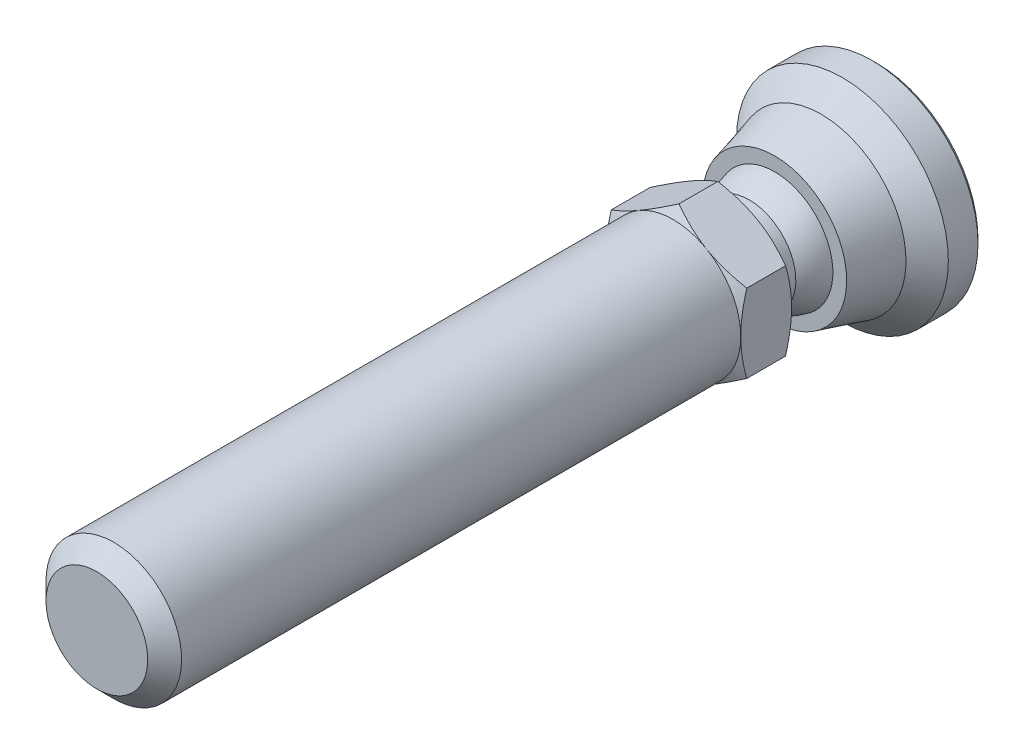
ISO-10303-21;
HEADER;
FILE_DESCRIPTION(('STEP AP214'),'2;1');
FILE_NAME('part.step','',(''),(''),'','','');
FILE_SCHEMA(('AUTOMOTIVE_DESIGN { 1 0 10303 214 1 1 1 1 }'));
ENDSEC;
DATA;
#1=APPLICATION_CONTEXT('core data for automotive mechanical design processes');
#2=APPLICATION_PROTOCOL_DEFINITION('international standard','automotive_design',2000,#1);
#3=PRODUCT_CONTEXT('',#1,'mechanical');
#4=PRODUCT('Part','Part','',(#3));
#5=PRODUCT_RELATED_PRODUCT_CATEGORY('part','',(#4));
#6=PRODUCT_DEFINITION_FORMATION('','',#4);
#7=PRODUCT_DEFINITION_CONTEXT('part definition',#1,'design');
#8=PRODUCT_DEFINITION('design','',#6,#7);
#9=PRODUCT_DEFINITION_SHAPE('','',#8);
#10=(LENGTH_UNIT() NAMED_UNIT(*) SI_UNIT(.MILLI.,.METRE.));
#11=(NAMED_UNIT(*) PLANE_ANGLE_UNIT() SI_UNIT($,.RADIAN.));
#12=(NAMED_UNIT(*) SI_UNIT($,.STERADIAN.) SOLID_ANGLE_UNIT());
#13=UNCERTAINTY_MEASURE_WITH_UNIT(LENGTH_MEASURE(1.E-05),#10,'distance_accuracy_value','');
#14=(GEOMETRIC_REPRESENTATION_CONTEXT(3) GLOBAL_UNCERTAINTY_ASSIGNED_CONTEXT((#13)) GLOBAL_UNIT_ASSIGNED_CONTEXT((#10,
#11,#12)) REPRESENTATION_CONTEXT('',''));
#15=CARTESIAN_POINT('',(0.,0.,0.));
#16=DIRECTION('',(0.,0.,1.));
#17=DIRECTION('',(1.,0.,0.));
#18=AXIS2_PLACEMENT_3D('',#15,#16,#17);
#19=CARTESIAN_POINT('',(-7.76470588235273,0.,18.));
#20=DIRECTION('',(0.,0.,1.));
#21=DIRECTION('',(0.,-1.,0.));
#22=AXIS2_PLACEMENT_3D('',#19,#20,#21);
#23=PLANE('',#22);
#24=CARTESIAN_POINT('',(0.,0.,18.));
#25=DIRECTION('',(0.,0.,-1.));
#26=DIRECTION('',(0.,1.,0.));
#27=AXIS2_PLACEMENT_3D('',#24,#25,#26);
#28=CIRCLE('',#27,5.49999999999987);
#29=CARTESIAN_POINT('',(0.,5.49999999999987,18.));
#30=VERTEX_POINT('',#29);
#31=EDGE_CURVE('E289',#30,#30,#28,.T.);
#32=ORIENTED_EDGE('',*,*,#31,.F.);
#33=EDGE_LOOP('',(#32));
#34=FACE_BOUND('',#33,.T.);
#35=CARTESIAN_POINT('',(0.,0.,18.));
#36=DIRECTION('',(0.,0.,1.));
#37=DIRECTION('',(0.,-1.,0.));
#38=AXIS2_PLACEMENT_3D('',#35,#36,#37);
#39=CIRCLE('',#38,7.99999999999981);
#40=CARTESIAN_POINT('',(-4.,-6.92820323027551,18.));
#41=VERTEX_POINT('',#40);
#42=CARTESIAN_POINT('',(4.,-6.92820323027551,18.));
#43=VERTEX_POINT('',#42);
#44=EDGE_CURVE('E106',#41,#43,#39,.T.);
#45=ORIENTED_EDGE('',*,*,#44,.F.);
#46=CARTESIAN_POINT('',(-8.,0.,18.));
#47=VERTEX_POINT('',#46);
#48=EDGE_CURVE('E117',#47,#41,#39,.T.);
#49=ORIENTED_EDGE('',*,*,#48,.F.);
#50=CARTESIAN_POINT('',(-4.,6.92820323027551,18.));
#51=VERTEX_POINT('',#50);
#52=EDGE_CURVE('E409',#51,#47,#39,.T.);
#53=ORIENTED_EDGE('',*,*,#52,.F.);
#54=CARTESIAN_POINT('',(4.,6.92820323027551,18.));
#55=VERTEX_POINT('',#54);
#56=EDGE_CURVE('E34',#55,#51,#39,.T.);
#57=ORIENTED_EDGE('',*,*,#56,.F.);
#58=CARTESIAN_POINT('',(8.,0.,18.));
#59=VERTEX_POINT('',#58);
#60=EDGE_CURVE('E140',#59,#55,#39,.T.);
#61=ORIENTED_EDGE('',*,*,#60,.F.);
#62=EDGE_CURVE('E119',#43,#59,#39,.T.);
#63=ORIENTED_EDGE('',*,*,#62,.F.);
#64=EDGE_LOOP('',(#45,#49,#53,#57,#61,#63));
#65=FACE_BOUND('',#64,.T.);
#66=ADVANCED_FACE('F14',(#34,#65),#23,.F.);
#67=CARTESIAN_POINT('',(0.,0.,0.));
#68=DIRECTION('',(0.,0.,-1.));
#69=DIRECTION('',(0.,1.,0.));
#70=AXIS2_PLACEMENT_3D('',#67,#68,#69);
#71=CYLINDRICAL_SURFACE('',#70,5.49999999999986);
#72=CARTESIAN_POINT('',(0.,0.,15.));
#73=DIRECTION('',(0.,0.,-1.));
#74=DIRECTION('',(0.,1.,0.));
#75=AXIS2_PLACEMENT_3D('',#72,#73,#74);
#76=CIRCLE('',#75,5.49999999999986);
#77=CARTESIAN_POINT('',(-5.49999999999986,0.,15.));
#78=VERTEX_POINT('',#77);
#79=EDGE_CURVE('E294',#78,#78,#76,.T.);
#80=ORIENTED_EDGE('',*,*,#79,.F.);
#81=EDGE_LOOP('',(#80));
#82=FACE_BOUND('',#81,.T.);
#83=ORIENTED_EDGE('',*,*,#31,.T.);
#84=EDGE_LOOP('',(#83));
#85=FACE_BOUND('',#84,.T.);
#86=ADVANCED_FACE('F255',(#82,#85),#71,.T.);
#87=CARTESIAN_POINT('',(1.38777878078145E-13,0.,10.6698729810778));
#88=DIRECTION('',(0.,0.,-1.));
#89=DIRECTION('',(-1.,0.,0.));
#90=AXIS2_PLACEMENT_3D('',#87,#88,#89);
#91=SPHERICAL_SURFACE('',#90,7.);
#92=CARTESIAN_POINT('',(0.,0.,12.));
#93=DIRECTION('',(0.,0.,-1.));
#94=DIRECTION('',(0.,1.,0.));
#95=AXIS2_PLACEMENT_3D('',#92,#93,#94);
#96=CIRCLE('',#95,6.87246404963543);
#97=CARTESIAN_POINT('',(-6.87246404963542,0.,12.));
#98=VERTEX_POINT('',#97);
#99=EDGE_CURVE('E297',#98,#98,#96,.T.);
#100=CARTESIAN_POINT('',(-6.87246404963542,0.,12.));
#101=CARTESIAN_POINT('',(-6.86587210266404,0.,12.0340591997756));
#102=CARTESIAN_POINT('',(-6.85902692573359,0.,12.0680693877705));
#103=CARTESIAN_POINT('',(-6.84483171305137,0.,12.1359842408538));
#104=CARTESIAN_POINT('',(-6.83748167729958,0.,12.1698889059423));
#105=CARTESIAN_POINT('',(-6.8222783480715,0.,12.2375852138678));
#106=CARTESIAN_POINT('',(-6.81442505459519,0.,12.2713768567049));
#107=CARTESIAN_POINT('',(-6.7982169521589,0.,12.3388396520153));
#108=CARTESIAN_POINT('',(-6.78986214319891,0.,12.3725108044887));
#109=CARTESIAN_POINT('',(-6.77265285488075,0.,12.4397251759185));
#110=CARTESIAN_POINT('',(-6.76379837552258,0.,12.473268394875));
#111=CARTESIAN_POINT('',(-6.74559170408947,0.,12.5402194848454));
#112=CARTESIAN_POINT('',(-6.73623951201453,0.,12.5736273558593));
#113=CARTESIAN_POINT('',(-6.71703948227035,0.,12.6403003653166));
#114=CARTESIAN_POINT('',(-6.70719164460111,0.,12.67356550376));
#115=CARTESIAN_POINT('',(-6.68700250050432,0.,12.7399456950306));
#116=CARTESIAN_POINT('',(-6.67666119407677,0.,12.7730607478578));
#117=CARTESIAN_POINT('',(-6.65548739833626,0.,12.8391334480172));
#118=CARTESIAN_POINT('',(-6.64465490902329,0.,12.8720910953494));
#119=CARTESIAN_POINT('',(-6.62250114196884,0.,12.9378416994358));
#120=CARTESIAN_POINT('',(-6.61117986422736,0.,12.9706346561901));
#121=CARTESIAN_POINT('',(-6.58805102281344,0.,13.0360486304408));
#122=CARTESIAN_POINT('',(-6.57624345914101,0.,13.0686696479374));
#123=CARTESIAN_POINT('',(-6.55214465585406,0.,13.1337325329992));
#124=CARTESIAN_POINT('',(-6.53985341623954,0.,13.1661744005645));
#125=CARTESIAN_POINT('',(-6.51478997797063,0.,13.2308718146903));
#126=CARTESIAN_POINT('',(-6.50201777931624,0.,13.2631273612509));
#127=CARTESIAN_POINT('',(-6.47599524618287,0.,13.3274450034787));
#128=CARTESIAN_POINT('',(-6.46274491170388,0.,13.3595070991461));
#129=CARTESIAN_POINT('',(-6.43576903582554,0.,13.4234307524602));
#130=CARTESIAN_POINT('',(-6.42204349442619,0.,13.455292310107));
#131=CARTESIAN_POINT('',(-6.39412023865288,0.,13.5188078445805));
#132=CARTESIAN_POINT('',(-6.37992252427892,0.,13.5504618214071));
#133=CARTESIAN_POINT('',(-6.35105806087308,0.,13.6135551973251));
#134=CARTESIAN_POINT('',(-6.33639131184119,0.,13.6449945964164));
#135=CARTESIAN_POINT('',(-6.30659202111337,0.,13.7076518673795));
#136=CARTESIAN_POINT('',(-6.29145947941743,0.,13.7388697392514));
#137=CARTESIAN_POINT('',(-6.26073194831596,0.,13.8010770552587));
#138=CARTESIAN_POINT('',(-6.24513695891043,0.,13.8320664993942));
#139=CARTESIAN_POINT('',(-6.21348797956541,0.,13.8938101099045));
#140=CARTESIAN_POINT('',(-6.19743398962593,0.,13.9245642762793));
#141=CARTESIAN_POINT('',(-6.16487055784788,0.,13.9858305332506));
#142=CARTESIAN_POINT('',(-6.14836111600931,0.,14.016342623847));
#143=CARTESIAN_POINT('',(-6.11489042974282,0.,14.0771179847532));
#144=CARTESIAN_POINT('',(-6.09792918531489,0.,14.107381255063));
#145=CARTESIAN_POINT('',(-6.06355864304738,0.,14.1676522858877));
#146=CARTESIAN_POINT('',(-6.04614934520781,0.,14.1976600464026));
#147=CARTESIAN_POINT('',(-6.01088654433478,0.,14.2574134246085));
#148=CARTESIAN_POINT('',(-5.99303304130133,0.,14.2871590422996));
#149=CARTESIAN_POINT('',(-5.95688577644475,0.,14.3463815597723));
#150=CARTESIAN_POINT('',(-5.93859201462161,0.,14.3758584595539));
#151=CARTESIAN_POINT('',(-5.90156827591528,0.,14.4345370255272));
#152=CARTESIAN_POINT('',(-5.88283829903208,0.,14.4637386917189));
#153=CARTESIAN_POINT('',(-5.84494627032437,0.,14.5218603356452));
#154=CARTESIAN_POINT('',(-5.82578421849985,0.,14.5507803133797));
#155=CARTESIAN_POINT('',(-5.78703227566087,0.,14.6083321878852));
#156=CARTESIAN_POINT('',(-5.76744238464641,0.,14.6369640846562));
#157=CARTESIAN_POINT('',(-5.72783909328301,0.,14.6939334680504));
#158=CARTESIAN_POINT('',(-5.70782569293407,0.,14.7222709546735));
#159=CARTESIAN_POINT('',(-5.66737980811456,0.,14.778645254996));
#160=CARTESIAN_POINT('',(-5.646947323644,0.,14.8066820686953));
#161=CARTESIAN_POINT('',(-5.60566778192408,0.,14.862448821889));
#162=CARTESIAN_POINT('',(-5.58482072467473,0.,14.8901787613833));
#163=CARTESIAN_POINT('',(-5.54271666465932,0.,14.9453256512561));
#164=CARTESIAN_POINT('',(-5.52145966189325,0.,14.9727426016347));
#165=CARTESIAN_POINT('',(-5.49999999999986,0.,15.));
#166=B_SPLINE_CURVE_WITH_KNOTS('',3,(#100,#101,#102,#103,#104,#105,#106,#107,#108,#109,#110,
#111,#112,#113,#114,#115,#116,#117,#118,#119,#120,#121,#122,#123,#124,#125,#126,#127,#128,#129,
#130,#131,#132,#133,#134,#135,#136,#137,#138,#139,#140,#141,#142,#143,#144,#145,#146,#147,#148,
#149,#150,#151,#152,#153,#154,#155,#156,#157,#158,#159,#160,#161,#162,#163,#164,#165),
.UNSPECIFIED.,.F.,.F.,(4,2,2,2,2,2,2,2,2,2,2,2,2,2,2,2,2,2,2,2,2,2,2,2,2,2,2,2,2,2,2,2,4),(0.,
0.104072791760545,0.208145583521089,0.312218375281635,0.416291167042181,0.520363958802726,
0.62443675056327,0.728509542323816,0.83258233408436,0.936655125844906,1.04072791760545,
1.144800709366,1.24887350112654,1.35294629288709,1.45701908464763,1.56109187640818,
1.66516466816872,1.76923745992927,1.87331025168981,1.97738304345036,2.0814558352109,
2.18552862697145,2.28960141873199,2.39367421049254,2.49774700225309,2.60181979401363,
2.70589258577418,2.80996537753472,2.91403816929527,3.01811096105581,3.12218375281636,
3.2262565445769,3.33032933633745),.UNSPECIFIED.);
#167=EDGE_CURVE('BSEAM251',#98,#78,#166,.T.);
#168=ORIENTED_EDGE('',*,*,#99,.F.);
#169=ORIENTED_EDGE('',*,*,#79,.T.);
#170=ORIENTED_EDGE('',*,*,#167,.T.);
#171=ORIENTED_EDGE('',*,*,#167,.F.);
#172=EDGE_LOOP('',(#168,#170,#169,#171));
#173=FACE_BOUND('',#172,.T.);
#174=ADVANCED_FACE('F251',(#173),#91,.T.);
#175=CARTESIAN_POINT('',(-8.5,0.,12.));
#176=DIRECTION('',(0.,0.,-1.));
#177=DIRECTION('',(0.,1.,0.));
#178=AXIS2_PLACEMENT_3D('',#175,#176,#177);
#179=PLANE('',#178);
#180=CARTESIAN_POINT('',(0.,0.,12.));
#181=DIRECTION('',(0.,0.,-1.));
#182=DIRECTION('',(0.,1.,0.));
#183=AXIS2_PLACEMENT_3D('',#180,#181,#182);
#184=CIRCLE('',#183,8.5);
#185=CARTESIAN_POINT('',(0.,8.5,12.));
#186=VERTEX_POINT('',#185);
#187=EDGE_CURVE('E300',#186,#186,#184,.T.);
#188=ORIENTED_EDGE('',*,*,#187,.F.);
#189=EDGE_LOOP('',(#188));
#190=FACE_BOUND('',#189,.T.);
#191=ORIENTED_EDGE('',*,*,#99,.T.);
#192=EDGE_LOOP('',(#191));
#193=FACE_BOUND('',#192,.T.);
#194=ADVANCED_FACE('F247',(#190,#193),#179,.F.);
#195=CARTESIAN_POINT('',(0.,0.,12.));
#196=DIRECTION('',(0.,0.,-1.));
#197=DIRECTION('',(0.,1.,0.));
#198=AXIS2_PLACEMENT_3D('',#195,#196,#197);
#199=CONICAL_SURFACE('',#198,8.5,0.266252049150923);
#200=CARTESIAN_POINT('',(0.,0.,6.5));
#201=DIRECTION('',(0.,0.,-1.));
#202=DIRECTION('',(0.,1.,0.));
#203=AXIS2_PLACEMENT_3D('',#200,#201,#202);
#204=CIRCLE('',#203,10.);
#205=CARTESIAN_POINT('',(0.,10.,6.5));
#206=VERTEX_POINT('',#205);
#207=EDGE_CURVE('E303',#206,#206,#204,.T.);
#208=ORIENTED_EDGE('',*,*,#207,.F.);
#209=EDGE_LOOP('',(#208));
#210=FACE_BOUND('',#209,.T.);
#211=ORIENTED_EDGE('',*,*,#187,.T.);
#212=EDGE_LOOP('',(#211));
#213=FACE_BOUND('',#212,.T.);
#214=ADVANCED_FACE('F243',(#210,#213),#199,.T.);
#215=CARTESIAN_POINT('',(0.,0.,6.5));
#216=DIRECTION('',(0.,0.,-1.));
#217=DIRECTION('',(0.,1.,0.));
#218=AXIS2_PLACEMENT_3D('',#215,#216,#217);
#219=CONICAL_SURFACE('',#218,10.,0.785398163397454);
#220=CARTESIAN_POINT('',(0.,0.,4.));
#221=DIRECTION('',(0.,0.,-1.));
#222=DIRECTION('',(0.,1.,0.));
#223=AXIS2_PLACEMENT_3D('',#220,#221,#222);
#224=CIRCLE('',#223,12.5);
#225=CARTESIAN_POINT('',(0.,12.5,4.));
#226=VERTEX_POINT('',#225);
#227=EDGE_CURVE('E306',#226,#226,#224,.T.);
#228=ORIENTED_EDGE('',*,*,#227,.F.);
#229=EDGE_LOOP('',(#228));
#230=FACE_BOUND('',#229,.T.);
#231=ORIENTED_EDGE('',*,*,#207,.T.);
#232=EDGE_LOOP('',(#231));
#233=FACE_BOUND('',#232,.T.);
#234=ADVANCED_FACE('F239',(#230,#233),#219,.T.);
#235=CARTESIAN_POINT('',(0.,0.,0.));
#236=DIRECTION('',(0.,0.,-1.));
#237=DIRECTION('',(0.,1.,0.));
#238=AXIS2_PLACEMENT_3D('',#235,#236,#237);
#239=CYLINDRICAL_SURFACE('',#238,12.5);
#240=CARTESIAN_POINT('',(0.,0.,0.499999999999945));
#241=DIRECTION('',(0.,0.,-1.));
#242=DIRECTION('',(0.,1.,0.));
#243=AXIS2_PLACEMENT_3D('',#240,#241,#242);
#244=CIRCLE('',#243,12.5);
#245=CARTESIAN_POINT('',(0.,12.5,0.499999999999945));
#246=VERTEX_POINT('',#245);
#247=EDGE_CURVE('E309',#246,#246,#244,.T.);
#248=ORIENTED_EDGE('',*,*,#247,.F.);
#249=EDGE_LOOP('',(#248));
#250=FACE_BOUND('',#249,.T.);
#251=ORIENTED_EDGE('',*,*,#227,.T.);
#252=EDGE_LOOP('',(#251));
#253=FACE_BOUND('',#252,.T.);
#254=ADVANCED_FACE('F235',(#250,#253),#239,.T.);
#255=CARTESIAN_POINT('',(0.,0.,0.499999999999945));
#256=DIRECTION('',(0.,0.,1.));
#257=DIRECTION('',(0.,-1.,0.));
#258=AXIS2_PLACEMENT_3D('',#255,#256,#257);
#259=CONICAL_SURFACE('',#258,12.5,0.785398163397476);
#260=CARTESIAN_POINT('',(0.,0.,0.));
#261=DIRECTION('',(0.,0.,-1.));
#262=DIRECTION('',(0.,1.,0.));
#263=AXIS2_PLACEMENT_3D('',#260,#261,#262);
#264=CIRCLE('',#263,12.);
#265=CARTESIAN_POINT('',(0.,12.,0.));
#266=VERTEX_POINT('',#265);
#267=EDGE_CURVE('E312',#266,#266,#264,.T.);
#268=ORIENTED_EDGE('',*,*,#267,.F.);
#269=EDGE_LOOP('',(#268));
#270=FACE_BOUND('',#269,.T.);
#271=ORIENTED_EDGE('',*,*,#247,.T.);
#272=EDGE_LOOP('',(#271));
#273=FACE_BOUND('',#272,.T.);
#274=ADVANCED_FACE('F231',(#270,#273),#259,.T.);
#275=CARTESIAN_POINT('',(-12.,0.,0.));
#276=DIRECTION('',(0.,0.,1.));
#277=DIRECTION('',(0.,-1.,0.));
#278=AXIS2_PLACEMENT_3D('',#275,#276,#277);
#279=PLANE('',#278);
#280=ORIENTED_EDGE('',*,*,#267,.T.);
#281=EDGE_LOOP('',(#280));
#282=FACE_BOUND('',#281,.T.);
#283=ADVANCED_FACE('F163',(#282),#279,.F.);
#284=CARTESIAN_POINT('',(0.,0.,18.));
#285=DIRECTION('',(0.,0.,1.));
#286=DIRECTION('',(0.,-1.,0.));
#287=AXIS2_PLACEMENT_3D('',#284,#285,#286);
#288=CONICAL_SURFACE('',#287,7.99999999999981,1.04719755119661);
#289=CARTESIAN_POINT('',(8.,12.3488343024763,21.8761710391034));
#290=CARTESIAN_POINT('',(8.,11.9999076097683,21.7071436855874));
#291=CARTESIAN_POINT('',(8.,11.6501737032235,21.5397538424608));
#292=CARTESIAN_POINT('',(8.,10.9486619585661,21.209171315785));
#293=CARTESIAN_POINT('',(8.,10.59688380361,21.0459793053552));
#294=CARTESIAN_POINT('',(8.,9.88901362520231,20.7238811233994));
#295=CARTESIAN_POINT('',(8.,9.53290850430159,20.5650036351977));
#296=CARTESIAN_POINT('',(8.,8.81784571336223,20.2538280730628));
#297=CARTESIAN_POINT('',(8.,8.45888818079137,20.1015296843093));
#298=CARTESIAN_POINT('',(8.,7.72617763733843,19.8005804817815));
#299=CARTESIAN_POINT('',(8.,7.3523147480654,19.6521956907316));
#300=CARTESIAN_POINT('',(8.,6.60019458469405,19.366797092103));
#301=CARTESIAN_POINT('',(8.,6.22193681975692,19.2297845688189));
#302=CARTESIAN_POINT('',(8.,5.46114748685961,18.9707703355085));
#303=CARTESIAN_POINT('',(8.,5.07862655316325,18.8487377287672));
#304=CARTESIAN_POINT('',(8.,4.30811202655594,18.6236355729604));
#305=CARTESIAN_POINT('',(8.,3.92012021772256,18.5205599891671));
#306=CARTESIAN_POINT('',(8.,3.14052679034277,18.3389100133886));
#307=CARTESIAN_POINT('',(8.,2.74895655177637,18.2602046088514));
#308=CARTESIAN_POINT('',(8.,2.1580821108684,18.1638590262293));
#309=CARTESIAN_POINT('',(8.,1.96052246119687,18.1353612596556));
#310=CARTESIAN_POINT('',(8.,1.56444098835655,18.0861634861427));
#311=CARTESIAN_POINT('',(8.,1.3659192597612,18.0654627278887));
#312=CARTESIAN_POINT('',(8.,0.970747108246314,18.0325279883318));
#313=CARTESIAN_POINT('',(8.,0.774105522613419,18.0201883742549));
#314=CARTESIAN_POINT('',(8.,0.380477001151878,18.0038317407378));
#315=CARTESIAN_POINT('',(8.,0.183490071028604,17.9998145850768));
#316=CARTESIAN_POINT('',(8.,-0.210477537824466,18.0001985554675));
#317=CARTESIAN_POINT('',(8.,-0.407458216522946,18.0045997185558));
#318=CARTESIAN_POINT('',(8.,-0.801060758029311,18.0217137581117));
#319=CARTESIAN_POINT('',(8.,-0.997682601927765,18.0344270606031));
#320=CARTESIAN_POINT('',(8.,-1.47200426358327,18.0748551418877));
#321=CARTESIAN_POINT('',(8.,-1.74936660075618,18.1066125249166));
#322=CARTESIAN_POINT('',(8.,-2.30198132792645,18.1849212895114));
#323=CARTESIAN_POINT('',(8.,-2.57723341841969,18.2314747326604));
#324=CARTESIAN_POINT('',(8.,-3.39953934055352,18.3908561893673));
#325=CARTESIAN_POINT('',(8.,-3.94282434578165,18.5233746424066));
#326=CARTESIAN_POINT('',(8.,-4.7550805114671,18.7525204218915));
#327=CARTESIAN_POINT('',(8.,-5.02828152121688,18.8350110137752));
#328=CARTESIAN_POINT('',(8.,-5.57202906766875,19.0083982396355));
#329=CARTESIAN_POINT('',(8.,-5.8425755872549,19.0992949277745));
#330=CARTESIAN_POINT('',(8.,-6.38110216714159,19.2880494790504));
#331=CARTESIAN_POINT('',(8.,-6.64908307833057,19.3859049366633));
#332=CARTESIAN_POINT('',(8.,-7.18283582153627,19.5874418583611));
#333=CARTESIAN_POINT('',(8.,-7.4486076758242,19.6911232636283));
#334=CARTESIAN_POINT('',(8.,-8.0605518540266,19.9363476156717));
#335=CARTESIAN_POINT('',(8.,-8.40602278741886,20.0796372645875));
#336=CARTESIAN_POINT('',(8.,-9.09414576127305,20.3728509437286));
#337=CARTESIAN_POINT('',(8.,-9.43679764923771,20.5227753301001));
#338=CARTESIAN_POINT('',(8.,-10.1197806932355,20.8279690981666));
#339=CARTESIAN_POINT('',(8.,-10.4601114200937,20.9832394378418));
#340=CARTESIAN_POINT('',(8.,-11.1387766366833,21.2980905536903));
#341=CARTESIAN_POINT('',(8.,-11.477111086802,21.4576714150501));
#342=CARTESIAN_POINT('',(8.,-12.1524257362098,21.7805147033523));
#343=CARTESIAN_POINT('',(8.,-12.4894042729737,21.9437806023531));
#344=CARTESIAN_POINT('',(8.,-13.1619319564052,22.2732329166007));
#345=CARTESIAN_POINT('',(8.,-13.497481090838,22.4394193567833));
#346=CARTESIAN_POINT('',(8.,-14.5022354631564,22.9415646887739));
#347=CARTESIAN_POINT('',(8.,-15.1696288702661,23.2811487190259));
#348=CARTESIAN_POINT('',(8.,-16.4475271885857,23.9396918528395));
#349=CARTESIAN_POINT('',(8.,-17.0583052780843,24.2581231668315));
#350=CARTESIAN_POINT('',(8.,-18.2775677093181,24.8993904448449));
#351=CARTESIAN_POINT('',(7.99999999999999,-18.8860519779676,25.2222265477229));
#352=CARTESIAN_POINT('',(7.99999999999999,-20.0998081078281,25.8705156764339));
#353=CARTESIAN_POINT('',(7.99999999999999,-20.7050841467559,26.1959608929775));
#354=CARTESIAN_POINT('',(7.99999999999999,-21.9141600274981,26.8495090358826));
#355=CARTESIAN_POINT('',(8.,-22.5179599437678,27.1776118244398));
#356=CARTESIAN_POINT('',(8.,-23.1212120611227,27.5067119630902));
#357=B_SPLINE_CURVE_WITH_KNOTS('',3,(#289,#290,#291,#292,#293,#294,#295,#296,#297,#298,#299,
#300,#301,#302,#303,#304,#305,#306,#307,#308,#309,#310,#311,#312,#313,#314,#315,#316,#317,#318,
#319,#320,#321,#322,#323,#324,#325,#326,#327,#328,#329,#330,#331,#332,#333,#334,#335,#336,#337,
#338,#339,#340,#341,#342,#343,#344,#345,#346,#347,#348,#349,#350,#351,#352,#353,#354,#355,#356),
.UNSPECIFIED.,.F.,.F.,(4,2,2,2,2,2,2,2,2,2,2,2,2,2,2,2,2,2,2,2,2,2,2,2,2,2,2,2,2,2,2,2,2,4),(0.,
1.16314850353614,2.32648236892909,3.49624795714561,4.66595750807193,5.872513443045,
7.07920545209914,8.2833652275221,9.48714100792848,10.6843282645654,11.2830119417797,
11.8816379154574,12.4725524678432,13.0634573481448,13.6543648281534,14.2453025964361,
15.0823518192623,15.9195177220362,17.594805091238,18.4508849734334,19.3069703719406,
20.1627612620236,21.018543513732,22.1404762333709,23.2624692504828,24.3846643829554,
25.5068817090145,26.6302046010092,27.7535370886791,29.9999316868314,32.0663188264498,
34.1327712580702,36.1944293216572,38.2559811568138),.UNSPECIFIED.);
#358=CARTESIAN_POINT('',(8.,4.61880215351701,18.7145311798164));
#359=VERTEX_POINT('',#358);
#360=EDGE_CURVE('E141',#359,#59,#357,.T.);
#361=ORIENTED_EDGE('',*,*,#360,.T.);
#362=ORIENTED_EDGE('',*,*,#60,.T.);
#363=CARTESIAN_POINT('',(-0.00019999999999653,9.23771977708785,18.714597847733));
#364=CARTESIAN_POINT('',(0.175648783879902,9.13619343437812,18.6559907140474));
#365=CARTESIAN_POINT('',(0.352153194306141,9.03428856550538,18.6000434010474));
#366=CARTESIAN_POINT('',(0.706595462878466,8.82965122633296,18.4942010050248));
#367=CARTESIAN_POINT('',(0.884533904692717,8.72691841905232,18.4443085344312));
#368=CARTESIAN_POINT('',(1.42119823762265,8.41707512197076,18.304692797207));
#369=CARTESIAN_POINT('',(1.78204258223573,8.20874154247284,18.2252811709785));
#370=CARTESIAN_POINT('',(2.32203917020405,7.89697436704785,18.1321616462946));
#371=CARTESIAN_POINT('',(2.49957818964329,7.79447216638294,18.1056345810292));
#372=CARTESIAN_POINT('',(2.8554591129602,7.58900421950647,18.061153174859));
#373=CARTESIAN_POINT('',(3.03380094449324,7.4860385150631,18.0431980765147));
#374=CARTESIAN_POINT('',(3.3907916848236,7.27992981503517,18.016315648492));
#375=CARTESIAN_POINT('',(3.5694400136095,7.17678715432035,18.0073780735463));
#376=CARTESIAN_POINT('',(3.92690170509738,6.97040655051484,17.9987223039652));
#377=CARTESIAN_POINT('',(4.10571506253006,6.86716861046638,17.9990038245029));
#378=CARTESIAN_POINT('',(4.4400133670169,6.67416139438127,18.0081450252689));
#379=CARTESIAN_POINT('',(4.59552190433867,6.58437849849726,18.0158896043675));
#380=CARTESIAN_POINT('',(4.90617476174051,6.40502298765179,18.0382011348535));
#381=CARTESIAN_POINT('',(5.06131905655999,6.31545038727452,18.0527685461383));
#382=CARTESIAN_POINT('',(5.52615131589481,6.04707935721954,18.1063606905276));
#383=CARTESIAN_POINT('',(5.83501648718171,5.86875596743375,18.1552686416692));
#384=CARTESIAN_POINT('',(6.4560232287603,5.51021755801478,18.2775394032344));
#385=CARTESIAN_POINT('',(6.76808554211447,5.33004829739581,18.3514205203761));
#386=CARTESIAN_POINT('',(7.38755648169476,4.97239658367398,18.5191001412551));
#387=CARTESIAN_POINT('',(7.69497304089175,4.79490955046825,18.6128592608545));
#388=CARTESIAN_POINT('',(8.0002,4.61868668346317,18.714597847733));
#389=B_SPLINE_CURVE_WITH_KNOTS('',3,(#363,#364,#365,#366,#367,#368,#369,#370,#371,#372,#373,
#374,#375,#376,#377,#378,#379,#380,#381,#382,#383,#384,#385,#386,#387,#388),.UNSPECIFIED.,.F.,
.F.,(4,2,2,2,2,2,2,2,2,2,2,2,4),(0.,0.633973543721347,1.26821965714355,2.53934712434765,
3.15934343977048,3.77928496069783,4.39852133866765,5.01773858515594,5.55680239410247,
6.09590254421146,7.17487077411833,8.27776850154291,9.37850115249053),.UNSPECIFIED.);
#390=EDGE_CURVE('E18',#55,#359,#389,.T.);
#391=ORIENTED_EDGE('',*,*,#390,.T.);
#392=EDGE_LOOP('',(#361,#362,#391));
#393=FACE_BOUND('',#392,.T.);
#394=ADVANCED_FACE('F158',(#393),#288,.T.);
#395=CARTESIAN_POINT('',(-8.0002,4.61868668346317,18.714597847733));
#396=CARTESIAN_POINT('',(-7.8243512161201,4.7202130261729,18.6559907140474));
#397=CARTESIAN_POINT('',(-7.64784680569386,4.82211789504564,18.6000434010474));
#398=CARTESIAN_POINT('',(-7.29340453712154,5.02675523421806,18.4942010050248));
#399=CARTESIAN_POINT('',(-7.11546609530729,5.1294880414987,18.4443085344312));
#400=CARTESIAN_POINT('',(-6.57880176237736,5.43933133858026,18.304692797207));
#401=CARTESIAN_POINT('',(-6.21795741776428,5.64766491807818,18.2252811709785));
#402=CARTESIAN_POINT('',(-5.67796082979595,5.95943209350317,18.1321616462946));
#403=CARTESIAN_POINT('',(-5.50042181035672,6.06193429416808,18.1056345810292));
#404=CARTESIAN_POINT('',(-5.1445408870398,6.26740224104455,18.061153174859));
#405=CARTESIAN_POINT('',(-4.96619905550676,6.37036794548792,18.0431980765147));
#406=CARTESIAN_POINT('',(-4.60920831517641,6.57647664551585,18.016315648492));
#407=CARTESIAN_POINT('',(-4.4305599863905,6.67961930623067,18.0073780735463));
#408=CARTESIAN_POINT('',(-4.07309829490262,6.88599991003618,17.9987223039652));
#409=CARTESIAN_POINT('',(-3.89428493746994,6.98923785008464,17.9990038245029));
#410=CARTESIAN_POINT('',(-3.5599866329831,7.18224506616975,18.0081450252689));
#411=CARTESIAN_POINT('',(-3.40447809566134,7.27202796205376,18.0158896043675));
#412=CARTESIAN_POINT('',(-3.0938252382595,7.45138347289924,18.0382011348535));
#413=CARTESIAN_POINT('',(-2.93868094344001,7.5409560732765,18.0527685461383));
#414=CARTESIAN_POINT('',(-2.47384868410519,7.80932710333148,18.1063606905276));
#415=CARTESIAN_POINT('',(-2.16498351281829,7.98765049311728,18.1552686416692));
#416=CARTESIAN_POINT('',(-1.54397677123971,8.34618890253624,18.2775394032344));
#417=CARTESIAN_POINT('',(-1.23191445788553,8.52635816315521,18.3514205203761));
#418=CARTESIAN_POINT('',(-0.612443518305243,8.88400987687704,18.5191001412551));
#419=CARTESIAN_POINT('',(-0.305026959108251,9.06149691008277,18.6128592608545));
#420=CARTESIAN_POINT('',(0.000200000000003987,9.23771977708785,18.714597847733));
#421=B_SPLINE_CURVE_WITH_KNOTS('',3,(#395,#396,#397,#398,#399,#400,#401,#402,#403,#404,#405,
#406,#407,#408,#409,#410,#411,#412,#413,#414,#415,#416,#417,#418,#419,#420),.UNSPECIFIED.,.F.,
.F.,(4,2,2,2,2,2,2,2,2,2,2,2,4),(0.,0.633973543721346,1.26821965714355,2.53934712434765,
3.15934343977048,3.77928496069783,4.39852133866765,5.01773858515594,5.55680239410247,
6.09590254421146,7.17487077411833,8.27776850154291,9.37850115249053),.UNSPECIFIED.);
#422=CARTESIAN_POINT('',(0.,9.23760430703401,18.7145311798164));
#423=VERTEX_POINT('',#422);
#424=EDGE_CURVE('E142',#51,#423,#421,.T.);
#425=ORIENTED_EDGE('',*,*,#424,.T.);
#426=EDGE_CURVE('E9',#423,#55,#389,.T.);
#427=ORIENTED_EDGE('',*,*,#426,.T.);
#428=ORIENTED_EDGE('',*,*,#56,.T.);
#429=EDGE_LOOP('',(#425,#427,#428));
#430=FACE_BOUND('',#429,.T.);
#431=ADVANCED_FACE('F162',(#430),#288,.T.);
#432=CARTESIAN_POINT('',(8.0002,-4.61868668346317,18.714597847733));
#433=CARTESIAN_POINT('',(7.8243512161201,-4.7202130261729,18.6559907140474));
#434=CARTESIAN_POINT('',(7.64784680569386,-4.82211789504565,18.6000434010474));
#435=CARTESIAN_POINT('',(7.29340453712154,-5.02675523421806,18.4942010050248));
#436=CARTESIAN_POINT('',(7.11546609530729,-5.1294880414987,18.4443085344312));
#437=CARTESIAN_POINT('',(6.57880176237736,-5.43933133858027,18.304692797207));
#438=CARTESIAN_POINT('',(6.21795741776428,-5.64766491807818,18.2252811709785));
#439=CARTESIAN_POINT('',(5.67796082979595,-5.95943209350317,18.1321616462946));
#440=CARTESIAN_POINT('',(5.50042181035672,-6.06193429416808,18.1056345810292));
#441=CARTESIAN_POINT('',(5.1445408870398,-6.26740224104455,18.061153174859));
#442=CARTESIAN_POINT('',(4.96619905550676,-6.37036794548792,18.0431980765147));
#443=CARTESIAN_POINT('',(4.60920831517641,-6.57647664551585,18.016315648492));
#444=CARTESIAN_POINT('',(4.4305599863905,-6.67961930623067,18.0073780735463));
#445=CARTESIAN_POINT('',(4.07309829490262,-6.88599991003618,17.9987223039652));
#446=CARTESIAN_POINT('',(3.89428493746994,-6.98923785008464,17.9990038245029));
#447=CARTESIAN_POINT('',(3.5599866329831,-7.18224506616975,18.0081450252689));
#448=CARTESIAN_POINT('',(3.40447809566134,-7.27202796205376,18.0158896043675));
#449=CARTESIAN_POINT('',(3.0938252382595,-7.45138347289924,18.0382011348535));
#450=CARTESIAN_POINT('',(2.93868094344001,-7.5409560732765,18.0527685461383));
#451=CARTESIAN_POINT('',(2.47384868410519,-7.80932710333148,18.1063606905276));
#452=CARTESIAN_POINT('',(2.16498351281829,-7.98765049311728,18.1552686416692));
#453=CARTESIAN_POINT('',(1.54397677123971,-8.34618890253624,18.2775394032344));
#454=CARTESIAN_POINT('',(1.23191445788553,-8.52635816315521,18.3514205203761));
#455=CARTESIAN_POINT('',(0.612443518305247,-8.88400987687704,18.5191001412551));
#456=CARTESIAN_POINT('',(0.305026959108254,-9.06149691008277,18.6128592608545));
#457=CARTESIAN_POINT('',(-0.000199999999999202,-9.23771977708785,18.714597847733));
#458=B_SPLINE_CURVE_WITH_KNOTS('',3,(#432,#433,#434,#435,#436,#437,#438,#439,#440,#441,#442,
#443,#444,#445,#446,#447,#448,#449,#450,#451,#452,#453,#454,#455,#456,#457),.UNSPECIFIED.,.F.,
.F.,(4,2,2,2,2,2,2,2,2,2,2,2,4),(0.,0.633973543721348,1.26821965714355,2.53934712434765,
3.15934343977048,3.77928496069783,4.39852133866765,5.01773858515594,5.55680239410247,
6.09590254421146,7.17487077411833,8.27776850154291,9.37850115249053),.UNSPECIFIED.);
#459=CARTESIAN_POINT('',(8.,-4.61880215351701,18.7145311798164));
#460=VERTEX_POINT('',#459);
#461=EDGE_CURVE('E122',#460,#43,#458,.T.);
#462=ORIENTED_EDGE('',*,*,#461,.T.);
#463=ORIENTED_EDGE('',*,*,#62,.T.);
#464=EDGE_CURVE('E126',#59,#460,#357,.T.);
#465=ORIENTED_EDGE('',*,*,#464,.T.);
#466=EDGE_LOOP('',(#462,#463,#465));
#467=FACE_BOUND('',#466,.T.);
#468=ADVANCED_FACE('F123',(#467),#288,.T.);
#469=CARTESIAN_POINT('',(0.000200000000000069,-9.23771977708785,18.714597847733));
#470=CARTESIAN_POINT('',(-0.175648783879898,-9.13619343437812,18.6559907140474));
#471=CARTESIAN_POINT('',(-0.352153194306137,-9.03428856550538,18.6000434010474));
#472=CARTESIAN_POINT('',(-0.706595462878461,-8.82965122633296,18.4942010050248));
#473=CARTESIAN_POINT('',(-0.884533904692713,-8.72691841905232,18.4443085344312));
#474=CARTESIAN_POINT('',(-1.42119823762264,-8.41707512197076,18.304692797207));
#475=CARTESIAN_POINT('',(-1.78204258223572,-8.20874154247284,18.2252811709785));
#476=CARTESIAN_POINT('',(-2.32203917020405,-7.89697436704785,18.1321616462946));
#477=CARTESIAN_POINT('',(-2.49957818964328,-7.79447216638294,18.1056345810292));
#478=CARTESIAN_POINT('',(-2.8554591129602,-7.58900421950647,18.061153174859));
#479=CARTESIAN_POINT('',(-3.03380094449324,-7.4860385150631,18.0431980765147));
#480=CARTESIAN_POINT('',(-3.39079168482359,-7.27992981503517,18.016315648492));
#481=CARTESIAN_POINT('',(-3.5694400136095,-7.17678715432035,18.0073780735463));
#482=CARTESIAN_POINT('',(-3.92690170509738,-6.97040655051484,17.9987223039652));
#483=CARTESIAN_POINT('',(-4.10571506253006,-6.86716861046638,17.9990038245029));
#484=CARTESIAN_POINT('',(-4.4400133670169,-6.67416139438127,18.0081450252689));
#485=CARTESIAN_POINT('',(-4.59552190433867,-6.58437849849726,18.0158896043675));
#486=CARTESIAN_POINT('',(-4.9061747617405,-6.40502298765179,18.0382011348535));
#487=CARTESIAN_POINT('',(-5.06131905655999,-6.31545038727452,18.0527685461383));
#488=CARTESIAN_POINT('',(-5.52615131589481,-6.04707935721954,18.1063606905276));
#489=CARTESIAN_POINT('',(-5.83501648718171,-5.86875596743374,18.1552686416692));
#490=CARTESIAN_POINT('',(-6.45602322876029,-5.51021755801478,18.2775394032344));
#491=CARTESIAN_POINT('',(-6.76808554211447,-5.33004829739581,18.3514205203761));
#492=CARTESIAN_POINT('',(-7.38755648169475,-4.97239658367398,18.5191001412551));
#493=CARTESIAN_POINT('',(-7.69497304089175,-4.79490955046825,18.6128592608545));
#494=CARTESIAN_POINT('',(-8.0002,-4.61868668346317,18.714597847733));
#495=B_SPLINE_CURVE_WITH_KNOTS('',3,(#469,#470,#471,#472,#473,#474,#475,#476,#477,#478,#479,
#480,#481,#482,#483,#484,#485,#486,#487,#488,#489,#490,#491,#492,#493,#494),.UNSPECIFIED.,.F.,
.F.,(4,2,2,2,2,2,2,2,2,2,2,2,4),(0.,0.633973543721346,1.26821965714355,2.53934712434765,
3.15934343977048,3.77928496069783,4.39852133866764,5.01773858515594,5.55680239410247,
6.09590254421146,7.17487077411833,8.27776850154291,9.37850115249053),.UNSPECIFIED.);
#496=CARTESIAN_POINT('',(0.,-9.23760430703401,18.7145311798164));
#497=VERTEX_POINT('',#496);
#498=EDGE_CURVE('E112',#497,#41,#495,.T.);
#499=ORIENTED_EDGE('',*,*,#498,.T.);
#500=ORIENTED_EDGE('',*,*,#44,.T.);
#501=EDGE_CURVE('E110',#43,#497,#458,.T.);
#502=ORIENTED_EDGE('',*,*,#501,.T.);
#503=EDGE_LOOP('',(#499,#500,#502));
#504=FACE_BOUND('',#503,.T.);
#505=ADVANCED_FACE('F108',(#504),#288,.T.);
#506=CARTESIAN_POINT('',(-8.,-4.618802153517,18.7145311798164));
#507=VERTEX_POINT('',#506);
#508=EDGE_CURVE('E137',#41,#507,#495,.T.);
#509=ORIENTED_EDGE('',*,*,#508,.T.);
#510=CARTESIAN_POINT('',(-8.,12.348834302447,21.8761710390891));
#511=CARTESIAN_POINT('',(-8.,11.9999076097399,21.7071436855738));
#512=CARTESIAN_POINT('',(-8.,11.6501737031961,21.5397538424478));
#513=CARTESIAN_POINT('',(-8.,10.9486619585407,21.2091713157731));
#514=CARTESIAN_POINT('',(-8.,10.5968838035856,21.0459793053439));
#515=CARTESIAN_POINT('',(-8.,9.88901362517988,20.7238811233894));
#516=CARTESIAN_POINT('',(-8.,9.53290850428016,20.5650036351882));
#517=CARTESIAN_POINT('',(-8.,8.81784571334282,20.2538280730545));
#518=CARTESIAN_POINT('',(-8.,8.45888818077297,20.1015296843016));
#519=CARTESIAN_POINT('',(-8.,7.72617763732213,19.800580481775));
#520=CARTESIAN_POINT('',(-8.,7.35231474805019,19.6521956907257));
#521=CARTESIAN_POINT('',(-8.,6.60019458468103,19.3667970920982));
#522=CARTESIAN_POINT('',(-8.,6.221936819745,19.2297845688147));
#523=CARTESIAN_POINT('',(-8.,5.46114748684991,18.9707703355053));
#524=CARTESIAN_POINT('',(-8.,5.07862655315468,18.8487377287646));
#525=CARTESIAN_POINT('',(-8.,4.30811202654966,18.6236355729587));
#526=CARTESIAN_POINT('',(-8.,3.92012021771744,18.5205599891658));
#527=CARTESIAN_POINT('',(-8.,3.14052679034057,18.3389100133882));
#528=CARTESIAN_POINT('',(-8.,2.74895655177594,18.2602046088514));
#529=CARTESIAN_POINT('',(-8.,2.15808211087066,18.1638590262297));
#530=CARTESIAN_POINT('',(-8.,1.96052246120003,18.1353612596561));
#531=CARTESIAN_POINT('',(-8.,1.56444098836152,18.0861634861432));
#532=CARTESIAN_POINT('',(-8.,1.36591925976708,18.0654627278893));
#533=CARTESIAN_POINT('',(-8.,0.970747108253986,18.0325279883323));
#534=CARTESIAN_POINT('',(-8.,0.774105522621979,18.0201883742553));
#535=CARTESIAN_POINT('',(-8.,0.380477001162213,18.0038317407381));
#536=CARTESIAN_POINT('',(-8.,0.183490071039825,17.999814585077));
#537=CARTESIAN_POINT('',(-8.,-0.210477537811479,18.0001985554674));
#538=CARTESIAN_POINT('',(-8.,-0.40745821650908,18.0045997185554));
#539=CARTESIAN_POINT('',(-8.,-0.801060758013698,18.0217137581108));
#540=CARTESIAN_POINT('',(-8.,-0.997682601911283,18.0344270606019));
#541=CARTESIAN_POINT('',(-8.,-1.47200426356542,18.0748551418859));
#542=CARTESIAN_POINT('',(-8.,-1.74936660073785,18.1066125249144));
#543=CARTESIAN_POINT('',(-8.,-2.30198132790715,18.1849212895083));
#544=CARTESIAN_POINT('',(-8.,-2.57723341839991,18.2314747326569));
#545=CARTESIAN_POINT('',(-8.,-3.39953934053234,18.3908561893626));
#546=CARTESIAN_POINT('',(-8.,-3.94282434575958,18.523374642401));
#547=CARTESIAN_POINT('',(-8.,-4.75508051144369,18.7525204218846));
#548=CARTESIAN_POINT('',(-8.,-5.02828152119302,18.8350110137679));
#549=CARTESIAN_POINT('',(-8.,-5.57202906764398,19.0083982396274));
#550=CARTESIAN_POINT('',(-8.,-5.84257558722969,19.099294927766));
#551=CARTESIAN_POINT('',(-8.,-6.38110216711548,19.288049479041));
#552=CARTESIAN_POINT('',(-8.,-6.649083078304,19.3859049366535));
#553=CARTESIAN_POINT('',(-8.,-7.18283582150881,19.5874418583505));
#554=CARTESIAN_POINT('',(-8.,-7.44860767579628,19.6911232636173));
#555=CARTESIAN_POINT('',(-8.,-8.06055185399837,19.9363476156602));
#556=CARTESIAN_POINT('',(-8.,-8.40602278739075,20.0796372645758));
#557=CARTESIAN_POINT('',(-8.,-9.09414576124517,20.3728509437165));
#558=CARTESIAN_POINT('',(-8.,-9.43679764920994,20.5227753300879));
#559=CARTESIAN_POINT('',(-8.,-10.1197806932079,20.8279690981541));
#560=CARTESIAN_POINT('',(-8.,-10.4601114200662,20.9832394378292));
#561=CARTESIAN_POINT('',(-8.,-11.138776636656,21.2980905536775));
#562=CARTESIAN_POINT('',(-8.,-11.4771110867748,21.4576714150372));
#563=CARTESIAN_POINT('',(-8.,-12.1524257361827,21.7805147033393));
#564=CARTESIAN_POINT('',(-8.,-12.4894042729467,21.9437806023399));
#565=CARTESIAN_POINT('',(-8.,-13.1619319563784,22.2732329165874));
#566=CARTESIAN_POINT('',(-8.,-13.4974810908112,22.43941935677));
#567=CARTESIAN_POINT('',(-8.,-14.5022354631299,22.9415646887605));
#568=CARTESIAN_POINT('',(-8.,-15.1696288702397,23.2811487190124));
#569=CARTESIAN_POINT('',(-8.,-16.4475271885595,23.9396918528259));
#570=CARTESIAN_POINT('',(-8.,-17.0583052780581,24.2581231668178));
#571=CARTESIAN_POINT('',(-8.,-18.277567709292,24.899390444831));
#572=CARTESIAN_POINT('',(-8.,-18.8860519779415,25.222226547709));
#573=CARTESIAN_POINT('',(-8.,-20.0998081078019,25.8705156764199));
#574=CARTESIAN_POINT('',(-8.,-20.7050841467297,26.1959608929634));
#575=CARTESIAN_POINT('',(-8.,-21.914160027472,26.8495090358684));
#576=CARTESIAN_POINT('',(-8.,-22.5179599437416,27.1776118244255));
#577=CARTESIAN_POINT('',(-8.,-23.1212120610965,27.5067119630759));
#578=B_SPLINE_CURVE_WITH_KNOTS('',3,(#510,#511,#512,#513,#514,#515,#516,#517,#518,#519,#520,
#521,#522,#523,#524,#525,#526,#527,#528,#529,#530,#531,#532,#533,#534,#535,#536,#537,#538,#539,
#540,#541,#542,#543,#544,#545,#546,#547,#548,#549,#550,#551,#552,#553,#554,#555,#556,#557,#558,
#559,#560,#561,#562,#563,#564,#565,#566,#567,#568,#569,#570,#571,#572,#573,#574,#575,#576,#577),
.UNSPECIFIED.,.F.,.F.,(4,2,2,2,2,2,2,2,2,2,2,2,2,2,2,2,2,2,2,2,2,2,2,2,2,2,2,2,2,2,2,2,2,4),(0.,
1.16314850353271,2.32648236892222,3.49624795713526,4.6659575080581,5.87251344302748,
7.07920545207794,8.28336522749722,9.48714100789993,10.6843282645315,11.283011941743,
11.881637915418,12.4725524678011,13.0634573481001,13.654364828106,14.2453025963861,
15.0823518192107,15.9195177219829,17.5948050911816,18.4508849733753,19.3069703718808,
20.1627612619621,21.0185435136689,22.1404762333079,23.2624692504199,24.3846643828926,
25.5068817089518,26.6302046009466,27.7535370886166,29.9999316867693,32.0663188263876,
34.1327712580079,36.1944293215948,38.2559811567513),.UNSPECIFIED.);
#579=EDGE_CURVE('E138',#507,#47,#578,.F.);
#580=ORIENTED_EDGE('',*,*,#579,.T.);
#581=ORIENTED_EDGE('',*,*,#48,.T.);
#582=EDGE_LOOP('',(#509,#580,#581));
#583=FACE_BOUND('',#582,.T.);
#584=ADVANCED_FACE('F408',(#583),#288,.T.);
#585=CARTESIAN_POINT('',(-8.,4.61880215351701,18.7145311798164));
#586=VERTEX_POINT('',#585);
#587=EDGE_CURVE('E130',#47,#586,#578,.F.);
#588=ORIENTED_EDGE('',*,*,#587,.T.);
#589=EDGE_CURVE('E338',#586,#51,#421,.T.);
#590=ORIENTED_EDGE('',*,*,#589,.T.);
#591=ORIENTED_EDGE('',*,*,#52,.T.);
#592=EDGE_LOOP('',(#588,#590,#591));
#593=FACE_BOUND('',#592,.T.);
#594=ADVANCED_FACE('F275',(#593),#288,.T.);
#595=CARTESIAN_POINT('',(-5.99999999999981,0.,92.));
#596=DIRECTION('',(0.,0.,-1.));
#597=DIRECTION('',(0.,1.,0.));
#598=AXIS2_PLACEMENT_3D('',#595,#596,#597);
#599=PLANE('',#598);
#600=CARTESIAN_POINT('',(0.,0.,92.));
#601=DIRECTION('',(0.,0.,-1.));
#602=DIRECTION('',(0.,1.,0.));
#603=AXIS2_PLACEMENT_3D('',#600,#601,#602);
#604=CIRCLE('',#603,5.99999999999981);
#605=CARTESIAN_POINT('',(0.,5.99999999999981,92.));
#606=VERTEX_POINT('',#605);
#607=EDGE_CURVE('E283',#606,#606,#604,.T.);
#608=ORIENTED_EDGE('',*,*,#607,.F.);
#609=EDGE_LOOP('',(#608));
#610=FACE_BOUND('',#609,.T.);
#611=ADVANCED_FACE('F16',(#610),#599,.F.);
#612=CARTESIAN_POINT('',(0.,0.,92.));
#613=DIRECTION('',(0.,0.,-1.));
#614=DIRECTION('',(0.,1.,0.));
#615=AXIS2_PLACEMENT_3D('',#612,#613,#614);
#616=CONICAL_SURFACE('',#615,5.99999999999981,0.785398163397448);
#617=CARTESIAN_POINT('',(0.,0.,90.));
#618=DIRECTION('',(0.,0.,-1.));
#619=DIRECTION('',(0.,1.,0.));
#620=AXIS2_PLACEMENT_3D('',#617,#618,#619);
#621=CIRCLE('',#620,7.99999999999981);
#622=CARTESIAN_POINT('',(0.,7.99999999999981,90.));
#623=VERTEX_POINT('',#622);
#624=EDGE_CURVE('E280',#623,#623,#621,.T.);
#625=ORIENTED_EDGE('',*,*,#624,.F.);
#626=EDGE_LOOP('',(#625));
#627=FACE_BOUND('',#626,.T.);
#628=ORIENTED_EDGE('',*,*,#607,.T.);
#629=EDGE_LOOP('',(#628));
#630=FACE_BOUND('',#629,.T.);
#631=ADVANCED_FACE('F266',(#627,#630),#616,.T.);
#632=CARTESIAN_POINT('',(0.,0.,0.));
#633=DIRECTION('',(0.,0.,-1.));
#634=DIRECTION('',(0.,1.,0.));
#635=AXIS2_PLACEMENT_3D('',#632,#633,#634);
#636=CYLINDRICAL_SURFACE('',#635,7.99999999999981);
#637=ORIENTED_EDGE('',*,*,#624,.T.);
#638=EDGE_LOOP('',(#637));
#639=FACE_BOUND('',#638,.T.);
#640=CARTESIAN_POINT('',(0.,0.,24.));
#641=DIRECTION('',(0.,0.,-1.));
#642=DIRECTION('',(0.,1.,0.));
#643=AXIS2_PLACEMENT_3D('',#640,#641,#642);
#644=CIRCLE('',#643,7.99999999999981);
#645=CARTESIAN_POINT('',(4.,6.92820323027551,24.));
#646=VERTEX_POINT('',#645);
#647=CARTESIAN_POINT('',(7.99999999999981,0.,24.));
#648=VERTEX_POINT('',#647);
#649=EDGE_CURVE('E288',#646,#648,#644,.T.);
#650=ORIENTED_EDGE('',*,*,#649,.F.);
#651=CARTESIAN_POINT('',(-3.99999999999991,6.92820323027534,24.));
#652=VERTEX_POINT('',#651);
#653=EDGE_CURVE('E284',#652,#646,#644,.T.);
#654=ORIENTED_EDGE('',*,*,#653,.F.);
#655=CARTESIAN_POINT('',(-7.99999999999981,0.,24.));
#656=VERTEX_POINT('',#655);
#657=EDGE_CURVE('E287',#656,#652,#644,.T.);
#658=ORIENTED_EDGE('',*,*,#657,.F.);
#659=CARTESIAN_POINT('',(-3.99999999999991,-6.92820323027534,24.));
#660=VERTEX_POINT('',#659);
#661=EDGE_CURVE('E356',#660,#656,#644,.T.);
#662=ORIENTED_EDGE('',*,*,#661,.F.);
#663=CARTESIAN_POINT('',(3.99999999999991,-6.92820323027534,24.));
#664=VERTEX_POINT('',#663);
#665=EDGE_CURVE('E363',#664,#660,#644,.T.);
#666=ORIENTED_EDGE('',*,*,#665,.F.);
#667=CARTESIAN_POINT('',(0.,0.,24.));
#668=DIRECTION('',(0.,0.,1.));
#669=DIRECTION('',(0.,-1.,0.));
#670=AXIS2_PLACEMENT_3D('',#667,#668,#669);
#671=CIRCLE('',#670,7.99999999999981);
#672=EDGE_CURVE('E360',#664,#648,#671,.T.);
#673=ORIENTED_EDGE('',*,*,#672,.T.);
#674=EDGE_LOOP('',(#650,#654,#658,#662,#666,#673));
#675=FACE_BOUND('',#674,.T.);
#676=ADVANCED_FACE('F263',(#639,#675),#636,.T.);
#677=CARTESIAN_POINT('',(0.,0.,22.5730498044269));
#678=DIRECTION('',(0.,0.,-1.));
#679=DIRECTION('',(0.,1.,0.));
#680=AXIS2_PLACEMENT_3D('',#677,#678,#679);
#681=CONICAL_SURFACE('',#680,10.4715502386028,1.0471975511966);
#682=CARTESIAN_POINT('',(0.000200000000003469,9.23771977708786,23.2854021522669));
#683=CARTESIAN_POINT('',(-0.175648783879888,9.13619343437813,23.3440092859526));
#684=CARTESIAN_POINT('',(-0.352153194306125,9.03428856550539,23.3999565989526));
#685=CARTESIAN_POINT('',(-0.70659546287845,8.82965122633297,23.5057989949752));
#686=CARTESIAN_POINT('',(-0.884533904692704,8.72691841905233,23.5556914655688));
#687=CARTESIAN_POINT('',(-1.42119823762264,8.41707512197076,23.695307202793));
#688=CARTESIAN_POINT('',(-1.78204258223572,8.20874154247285,23.7747188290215));
#689=CARTESIAN_POINT('',(-2.32203917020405,7.89697436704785,23.8678383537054));
#690=CARTESIAN_POINT('',(-2.49957818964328,7.79447216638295,23.8943654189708));
#691=CARTESIAN_POINT('',(-2.8554591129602,7.58900421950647,23.938846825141));
#692=CARTESIAN_POINT('',(-3.03380094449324,7.4860385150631,23.9568019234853));
#693=CARTESIAN_POINT('',(-3.39079168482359,7.27992981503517,23.983684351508));
#694=CARTESIAN_POINT('',(-3.5694400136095,7.17678715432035,23.9926219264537));
#695=CARTESIAN_POINT('',(-3.92690170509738,6.97040655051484,24.0012776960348));
#696=CARTESIAN_POINT('',(-4.10571506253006,6.86716861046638,24.0009961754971));
#697=CARTESIAN_POINT('',(-4.4400133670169,6.67416139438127,23.9918549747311));
#698=CARTESIAN_POINT('',(-4.59552190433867,6.58437849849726,23.9841103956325));
#699=CARTESIAN_POINT('',(-4.90617476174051,6.40502298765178,23.9617988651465));
#700=CARTESIAN_POINT('',(-5.06131905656,6.31545038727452,23.9472314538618));
#701=CARTESIAN_POINT('',(-5.52615131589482,6.04707935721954,23.8936393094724));
#702=CARTESIAN_POINT('',(-5.83501648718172,5.86875596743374,23.8447313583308));
#703=CARTESIAN_POINT('',(-6.4560232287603,5.51021755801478,23.7224605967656));
#704=CARTESIAN_POINT('',(-6.76808554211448,5.3300482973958,23.6485794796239));
#705=CARTESIAN_POINT('',(-7.38755648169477,4.97239658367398,23.4808998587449));
#706=CARTESIAN_POINT('',(-7.69497304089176,4.79490955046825,23.3871407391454));
#707=CARTESIAN_POINT('',(-8.0002,4.61868668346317,23.2854021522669));
#708=B_SPLINE_CURVE_WITH_KNOTS('',3,(#682,#683,#684,#685,#686,#687,#688,#689,#690,#691,#692,
#693,#694,#695,#696,#697,#698,#699,#700,#701,#702,#703,#704,#705,#706,#707),.UNSPECIFIED.,.F.,
.F.,(4,2,2,2,2,2,2,2,2,2,2,2,4),(0.,0.633973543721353,1.26821965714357,2.53934712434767,
3.1593434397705,3.77928496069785,4.39852133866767,5.01773858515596,5.5568023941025,
6.09590254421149,7.17487077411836,8.27776850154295,9.37850115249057),.UNSPECIFIED.);
#709=CARTESIAN_POINT('',(-8.,4.61880215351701,23.2854688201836));
#710=VERTEX_POINT('',#709);
#711=EDGE_CURVE('E213',#652,#710,#708,.T.);
#712=ORIENTED_EDGE('',*,*,#711,.T.);
#713=CARTESIAN_POINT('',(-8.,12.348834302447,20.1238289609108));
#714=CARTESIAN_POINT('',(-8.,11.9999076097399,20.2928563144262));
#715=CARTESIAN_POINT('',(-8.,11.6501737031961,20.4602461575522));
#716=CARTESIAN_POINT('',(-8.,10.9486619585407,20.7908286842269));
#717=CARTESIAN_POINT('',(-8.,10.5968838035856,20.9540206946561));
#718=CARTESIAN_POINT('',(-8.,9.88901362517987,21.2761188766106));
#719=CARTESIAN_POINT('',(-8.,9.53290850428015,21.4349963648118));
#720=CARTESIAN_POINT('',(-8.,8.81784571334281,21.7461719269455));
#721=CARTESIAN_POINT('',(-8.,8.45888818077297,21.8984703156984));
#722=CARTESIAN_POINT('',(-8.,7.72617763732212,22.199419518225));
#723=CARTESIAN_POINT('',(-8.,7.35231474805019,22.3478043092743));
#724=CARTESIAN_POINT('',(-8.,6.60019458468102,22.6332029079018));
#725=CARTESIAN_POINT('',(-8.,6.221936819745,22.7702154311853));
#726=CARTESIAN_POINT('',(-8.,5.46114748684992,23.0292296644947));
#727=CARTESIAN_POINT('',(-8.,5.07862655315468,23.1512622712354));
#728=CARTESIAN_POINT('',(-8.,4.30811202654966,23.3763644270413));
#729=CARTESIAN_POINT('',(-8.,3.92012021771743,23.4794400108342));
#730=CARTESIAN_POINT('',(-8.,3.14052679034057,23.6610899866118));
#731=CARTESIAN_POINT('',(-8.,2.74895655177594,23.7397953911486));
#732=CARTESIAN_POINT('',(-8.,2.15808211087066,23.8361409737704));
#733=CARTESIAN_POINT('',(-8.,1.96052246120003,23.8646387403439));
#734=CARTESIAN_POINT('',(-8.,1.56444098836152,23.9138365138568));
#735=CARTESIAN_POINT('',(-8.,1.36591925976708,23.9345372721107));
#736=CARTESIAN_POINT('',(-8.,0.970747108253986,23.9674720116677));
#737=CARTESIAN_POINT('',(-8.,0.774105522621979,23.9798116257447));
#738=CARTESIAN_POINT('',(-8.,0.380477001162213,23.9961682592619));
#739=CARTESIAN_POINT('',(-8.,0.183490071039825,24.000185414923));
#740=CARTESIAN_POINT('',(-8.,-0.21047753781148,23.9998014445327));
#741=CARTESIAN_POINT('',(-8.,-0.407458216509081,23.9954002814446));
#742=CARTESIAN_POINT('',(-8.,-0.8010607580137,23.9782862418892));
#743=CARTESIAN_POINT('',(-8.,-0.997682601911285,23.9655729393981));
#744=CARTESIAN_POINT('',(-8.,-1.47200426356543,23.9251448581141));
#745=CARTESIAN_POINT('',(-8.,-1.74936660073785,23.8933874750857));
#746=CARTESIAN_POINT('',(-8.,-2.30198132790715,23.8150787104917));
#747=CARTESIAN_POINT('',(-8.,-2.57723341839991,23.7685252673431));
#748=CARTESIAN_POINT('',(-8.,-3.39953934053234,23.6091438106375));
#749=CARTESIAN_POINT('',(-8.,-3.94282434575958,23.476625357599));
#750=CARTESIAN_POINT('',(-8.,-4.75508051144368,23.2474795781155));
#751=CARTESIAN_POINT('',(-8.,-5.028281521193,23.1649889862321));
#752=CARTESIAN_POINT('',(-8.,-5.57202906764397,22.9916017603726));
#753=CARTESIAN_POINT('',(-8.,-5.84257558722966,22.900705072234));
#754=CARTESIAN_POINT('',(-8.,-6.38110216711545,22.711950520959));
#755=CARTESIAN_POINT('',(-8.,-6.64908307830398,22.6140950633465));
#756=CARTESIAN_POINT('',(-8.,-7.18283582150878,22.4125581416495));
#757=CARTESIAN_POINT('',(-8.,-7.44860767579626,22.3088767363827));
#758=CARTESIAN_POINT('',(-8.,-8.06055185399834,22.0636523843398));
#759=CARTESIAN_POINT('',(-8.,-8.40602278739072,21.9203627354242));
#760=CARTESIAN_POINT('',(-8.,-9.09414576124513,21.6271490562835));
#761=CARTESIAN_POINT('',(-8.,-9.4367976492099,21.4772246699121));
#762=CARTESIAN_POINT('',(-8.,-10.1197806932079,21.1720309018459));
#763=CARTESIAN_POINT('',(-8.,-10.4601114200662,21.0167605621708));
#764=CARTESIAN_POINT('',(-8.,-11.1387766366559,20.7019094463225));
#765=CARTESIAN_POINT('',(-8.,-11.4771110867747,20.5423285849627));
#766=CARTESIAN_POINT('',(-8.,-12.1524257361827,20.2194852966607));
#767=CARTESIAN_POINT('',(-8.,-12.4894042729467,20.05621939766));
#768=CARTESIAN_POINT('',(-8.,-13.1619319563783,19.7267670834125));
#769=CARTESIAN_POINT('',(-8.,-13.4974810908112,19.56058064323));
#770=CARTESIAN_POINT('',(-8.,-14.5022354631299,19.0584353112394));
#771=CARTESIAN_POINT('',(-8.,-15.1696288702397,18.7188512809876));
#772=CARTESIAN_POINT('',(-8.,-16.4475271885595,18.060308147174));
#773=CARTESIAN_POINT('',(-8.,-17.0583052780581,17.7418768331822));
#774=CARTESIAN_POINT('',(-8.,-18.2775677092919,17.1006095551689));
#775=CARTESIAN_POINT('',(-8.,-18.8860519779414,16.7777734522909));
#776=CARTESIAN_POINT('',(-8.,-20.0998081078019,16.1294843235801));
#777=CARTESIAN_POINT('',(-8.,-20.7050841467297,15.8040391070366));
#778=CARTESIAN_POINT('',(-8.,-21.9141600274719,15.1504909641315));
#779=CARTESIAN_POINT('',(-8.,-22.5179599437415,14.8223881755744));
#780=CARTESIAN_POINT('',(-8.,-23.1212120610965,14.4932880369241));
#781=B_SPLINE_CURVE_WITH_KNOTS('',3,(#713,#714,#715,#716,#717,#718,#719,#720,#721,#722,#723,
#724,#725,#726,#727,#728,#729,#730,#731,#732,#733,#734,#735,#736,#737,#738,#739,#740,#741,#742,
#743,#744,#745,#746,#747,#748,#749,#750,#751,#752,#753,#754,#755,#756,#757,#758,#759,#760,#761,
#762,#763,#764,#765,#766,#767,#768,#769,#770,#771,#772,#773,#774,#775,#776,#777,#778,#779,#780),
.UNSPECIFIED.,.F.,.F.,(4,2,2,2,2,2,2,2,2,2,2,2,2,2,2,2,2,2,2,2,2,2,2,2,2,2,2,2,2,2,2,2,2,4),(0.,
1.1631485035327,2.32648236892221,3.49624795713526,4.6659575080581,5.87251344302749,
7.07920545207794,8.28336522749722,9.48714100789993,10.6843282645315,11.283011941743,
11.881637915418,12.4725524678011,13.0634573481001,13.6543648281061,14.2453025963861,
15.0823518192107,15.9195177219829,17.5948050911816,18.4508849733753,19.3069703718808,
20.1627612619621,21.0185435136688,22.1404762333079,23.2624692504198,24.3846643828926,
25.5068817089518,26.6302046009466,27.7535370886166,29.9999316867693,32.0663188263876,
34.1327712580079,36.1944293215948,38.2559811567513),.UNSPECIFIED.);
#782=EDGE_CURVE('E205',#710,#656,#781,.T.);
#783=ORIENTED_EDGE('',*,*,#782,.T.);
#784=ORIENTED_EDGE('',*,*,#657,.T.);
#785=EDGE_LOOP('',(#712,#783,#784));
#786=FACE_BOUND('',#785,.T.);
#787=ADVANCED_FACE('F265',(#786),#681,.T.);
#788=CARTESIAN_POINT('',(-8.,-4.61880215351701,23.2854688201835));
#789=VERTEX_POINT('',#788);
#790=EDGE_CURVE('E198',#656,#789,#781,.T.);
#791=ORIENTED_EDGE('',*,*,#790,.T.);
#792=CARTESIAN_POINT('',(-8.0002,-4.61868668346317,23.2854021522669));
#793=CARTESIAN_POINT('',(-7.82435121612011,-4.72021302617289,23.3440092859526));
#794=CARTESIAN_POINT('',(-7.64784680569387,-4.82211789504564,23.3999565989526));
#795=CARTESIAN_POINT('',(-7.29340453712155,-5.02675523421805,23.5057989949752));
#796=CARTESIAN_POINT('',(-7.11546609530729,-5.12948804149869,23.5556914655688));
#797=CARTESIAN_POINT('',(-6.57880176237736,-5.43933133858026,23.695307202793));
#798=CARTESIAN_POINT('',(-6.21795741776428,-5.64766491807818,23.7747188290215));
#799=CARTESIAN_POINT('',(-5.67796082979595,-5.95943209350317,23.8678383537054));
#800=CARTESIAN_POINT('',(-5.50042181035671,-6.06193429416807,23.8943654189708));
#801=CARTESIAN_POINT('',(-5.1445408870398,-6.26740224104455,23.938846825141));
#802=CARTESIAN_POINT('',(-4.96619905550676,-6.37036794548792,23.9568019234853));
#803=CARTESIAN_POINT('',(-4.6092083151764,-6.57647664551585,23.983684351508));
#804=CARTESIAN_POINT('',(-4.4305599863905,-6.67961930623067,23.9926219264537));
#805=CARTESIAN_POINT('',(-4.07309829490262,-6.88599991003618,24.0012776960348));
#806=CARTESIAN_POINT('',(-3.89428493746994,-6.98923785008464,24.0009961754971));
#807=CARTESIAN_POINT('',(-3.5599866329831,-7.18224506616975,23.9918549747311));
#808=CARTESIAN_POINT('',(-3.40447809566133,-7.27202796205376,23.9841103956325));
#809=CARTESIAN_POINT('',(-3.09382523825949,-7.45138347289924,23.9617988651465));
#810=CARTESIAN_POINT('',(-2.93868094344,-7.5409560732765,23.9472314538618));
#811=CARTESIAN_POINT('',(-2.47384868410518,-7.80932710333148,23.8936393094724));
#812=CARTESIAN_POINT('',(-2.16498351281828,-7.98765049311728,23.8447313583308));
#813=CARTESIAN_POINT('',(-1.5439767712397,-8.34618890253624,23.7224605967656));
#814=CARTESIAN_POINT('',(-1.23191445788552,-8.52635816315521,23.6485794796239));
#815=CARTESIAN_POINT('',(-0.612443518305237,-8.88400987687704,23.4808998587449));
#816=CARTESIAN_POINT('',(-0.305026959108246,-9.06149691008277,23.3871407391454));
#817=CARTESIAN_POINT('',(0.000199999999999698,-9.23771977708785,23.2854021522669));
#818=B_SPLINE_CURVE_WITH_KNOTS('',3,(#792,#793,#794,#795,#796,#797,#798,#799,#800,#801,#802,
#803,#804,#805,#806,#807,#808,#809,#810,#811,#812,#813,#814,#815,#816,#817),.UNSPECIFIED.,.F.,
.F.,(4,2,2,2,2,2,2,2,2,2,2,2,4),(0.,0.633973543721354,1.26821965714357,2.53934712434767,
3.1593434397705,3.77928496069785,4.39852133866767,5.01773858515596,5.55680239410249,
6.09590254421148,7.17487077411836,8.27776850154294,9.37850115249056),.UNSPECIFIED.);
#819=EDGE_CURVE('E206',#789,#660,#818,.T.);
#820=ORIENTED_EDGE('',*,*,#819,.T.);
#821=ORIENTED_EDGE('',*,*,#661,.T.);
#822=EDGE_LOOP('',(#791,#820,#821));
#823=FACE_BOUND('',#822,.T.);
#824=ADVANCED_FACE('F368',(#823),#681,.T.);
#825=CARTESIAN_POINT('',(0.,-9.23760430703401,23.2854688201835));
#826=VERTEX_POINT('',#825);
#827=EDGE_CURVE('E207',#660,#826,#818,.T.);
#828=ORIENTED_EDGE('',*,*,#827,.T.);
#829=CARTESIAN_POINT('',(-0.000199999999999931,-9.23771977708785,23.2854021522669));
#830=CARTESIAN_POINT('',(0.175648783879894,-9.13619343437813,23.3440092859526));
#831=CARTESIAN_POINT('',(0.352153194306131,-9.03428856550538,23.3999565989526));
#832=CARTESIAN_POINT('',(0.706595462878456,-8.82965122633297,23.5057989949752));
#833=CARTESIAN_POINT('',(0.884533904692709,-8.72691841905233,23.5556914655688));
#834=CARTESIAN_POINT('',(1.42119823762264,-8.41707512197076,23.695307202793));
#835=CARTESIAN_POINT('',(1.78204258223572,-8.20874154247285,23.7747188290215));
#836=CARTESIAN_POINT('',(2.32203917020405,-7.89697436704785,23.8678383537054));
#837=CARTESIAN_POINT('',(2.49957818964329,-7.79447216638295,23.8943654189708));
#838=CARTESIAN_POINT('',(2.8554591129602,-7.58900421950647,23.938846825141));
#839=CARTESIAN_POINT('',(3.03380094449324,-7.4860385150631,23.9568019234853));
#840=CARTESIAN_POINT('',(3.39079168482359,-7.27992981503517,23.983684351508));
#841=CARTESIAN_POINT('',(3.5694400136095,-7.17678715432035,23.9926219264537));
#842=CARTESIAN_POINT('',(3.92690170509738,-6.97040655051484,24.0012776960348));
#843=CARTESIAN_POINT('',(4.10571506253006,-6.86716861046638,24.0009961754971));
#844=CARTESIAN_POINT('',(4.4400133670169,-6.67416139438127,23.9918549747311));
#845=CARTESIAN_POINT('',(4.59552190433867,-6.58437849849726,23.9841103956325));
#846=CARTESIAN_POINT('',(4.90617476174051,-6.40502298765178,23.9617988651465));
#847=CARTESIAN_POINT('',(5.06131905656,-6.31545038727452,23.9472314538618));
#848=CARTESIAN_POINT('',(5.52615131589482,-6.04707935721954,23.8936393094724));
#849=CARTESIAN_POINT('',(5.83501648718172,-5.86875596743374,23.8447313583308));
#850=CARTESIAN_POINT('',(6.4560232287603,-5.51021755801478,23.7224605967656));
#851=CARTESIAN_POINT('',(6.76808554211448,-5.33004829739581,23.6485794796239));
#852=CARTESIAN_POINT('',(7.38755648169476,-4.97239658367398,23.4808998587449));
#853=CARTESIAN_POINT('',(7.69497304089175,-4.79490955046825,23.3871407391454));
#854=CARTESIAN_POINT('',(8.0002,-4.61868668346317,23.2854021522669));
#855=B_SPLINE_CURVE_WITH_KNOTS('',3,(#829,#830,#831,#832,#833,#834,#835,#836,#837,#838,#839,
#840,#841,#842,#843,#844,#845,#846,#847,#848,#849,#850,#851,#852,#853,#854),.UNSPECIFIED.,.F.,
.F.,(4,2,2,2,2,2,2,2,2,2,2,2,4),(0.,0.633973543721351,1.26821965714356,2.53934712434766,
3.1593434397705,3.77928496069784,4.39852133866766,5.01773858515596,5.55680239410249,
6.09590254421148,7.17487077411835,8.27776850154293,9.37850115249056),.UNSPECIFIED.);
#856=EDGE_CURVE('E371',#826,#664,#855,.T.);
#857=ORIENTED_EDGE('',*,*,#856,.T.);
#858=ORIENTED_EDGE('',*,*,#665,.T.);
#859=EDGE_LOOP('',(#828,#857,#858));
#860=FACE_BOUND('',#859,.T.);
#861=ADVANCED_FACE('F568',(#860),#681,.T.);
#862=CARTESIAN_POINT('',(8.,-4.61880215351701,23.2854688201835));
#863=VERTEX_POINT('',#862);
#864=EDGE_CURVE('E372',#664,#863,#855,.T.);
#865=ORIENTED_EDGE('',*,*,#864,.T.);
#866=CARTESIAN_POINT('',(8.,12.3488343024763,20.1238289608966));
#867=CARTESIAN_POINT('',(8.,11.9999076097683,20.2928563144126));
#868=CARTESIAN_POINT('',(8.,11.6501737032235,20.4602461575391));
#869=CARTESIAN_POINT('',(8.,10.9486619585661,20.790828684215));
#870=CARTESIAN_POINT('',(8.,10.59688380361,20.9540206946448));
#871=CARTESIAN_POINT('',(8.,9.8890136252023,21.2761188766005));
#872=CARTESIAN_POINT('',(8.,9.53290850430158,21.4349963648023));
#873=CARTESIAN_POINT('',(8.,8.81784571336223,21.7461719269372));
#874=CARTESIAN_POINT('',(8.,8.45888818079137,21.8984703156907));
#875=CARTESIAN_POINT('',(8.,7.72617763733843,22.1994195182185));
#876=CARTESIAN_POINT('',(8.,7.35231474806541,22.3478043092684));
#877=CARTESIAN_POINT('',(8.,6.60019458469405,22.633202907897));
#878=CARTESIAN_POINT('',(8.,6.22193681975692,22.7702154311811));
#879=CARTESIAN_POINT('',(8.,5.46114748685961,23.0292296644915));
#880=CARTESIAN_POINT('',(8.,5.07862655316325,23.1512622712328));
#881=CARTESIAN_POINT('',(8.,4.30811202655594,23.3763644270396));
#882=CARTESIAN_POINT('',(8.,3.92012021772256,23.4794400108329));
#883=CARTESIAN_POINT('',(8.,3.14052679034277,23.6610899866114));
#884=CARTESIAN_POINT('',(8.,2.74895655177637,23.7397953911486));
#885=CARTESIAN_POINT('',(8.,2.1580821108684,23.8361409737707));
#886=CARTESIAN_POINT('',(8.,1.96052246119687,23.8646387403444));
#887=CARTESIAN_POINT('',(8.,1.56444098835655,23.9138365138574));
#888=CARTESIAN_POINT('',(8.,1.3659192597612,23.9345372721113));
#889=CARTESIAN_POINT('',(8.,0.970747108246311,23.9674720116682));
#890=CARTESIAN_POINT('',(8.,0.774105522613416,23.9798116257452));
#891=CARTESIAN_POINT('',(8.,0.380477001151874,23.9961682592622));
#892=CARTESIAN_POINT('',(8.,0.1834900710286,24.0001854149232));
#893=CARTESIAN_POINT('',(8.,-0.210477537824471,23.9998014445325));
#894=CARTESIAN_POINT('',(8.,-0.407458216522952,23.9954002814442));
#895=CARTESIAN_POINT('',(8.,-0.801060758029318,23.9782862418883));
#896=CARTESIAN_POINT('',(8.,-0.997682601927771,23.9655729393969));
#897=CARTESIAN_POINT('',(8.,-1.47200426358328,23.9251448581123));
#898=CARTESIAN_POINT('',(8.,-1.74936660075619,23.8933874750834));
#899=CARTESIAN_POINT('',(8.,-2.30198132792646,23.8150787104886));
#900=CARTESIAN_POINT('',(8.,-2.57723341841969,23.7685252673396));
#901=CARTESIAN_POINT('',(8.,-3.39953934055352,23.6091438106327));
#902=CARTESIAN_POINT('',(8.,-3.94282434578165,23.4766253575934));
#903=CARTESIAN_POINT('',(8.,-4.75508051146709,23.2474795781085));
#904=CARTESIAN_POINT('',(8.,-5.02828152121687,23.1649889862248));
#905=CARTESIAN_POINT('',(8.,-5.57202906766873,22.9916017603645));
#906=CARTESIAN_POINT('',(8.,-5.84257558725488,22.9007050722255));
#907=CARTESIAN_POINT('',(8.,-6.38110216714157,22.7119505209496));
#908=CARTESIAN_POINT('',(8.,-6.64908307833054,22.6140950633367));
#909=CARTESIAN_POINT('',(8.,-7.18283582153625,22.4125581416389));
#910=CARTESIAN_POINT('',(8.,-7.44860767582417,22.3088767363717));
#911=CARTESIAN_POINT('',(8.,-8.06055185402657,22.0636523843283));
#912=CARTESIAN_POINT('',(8.,-8.40602278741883,21.9203627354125));
#913=CARTESIAN_POINT('',(8.,-9.09414576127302,21.6271490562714));
#914=CARTESIAN_POINT('',(8.,-9.43679764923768,21.4772246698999));
#915=CARTESIAN_POINT('',(8.,-10.1197806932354,21.1720309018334));
#916=CARTESIAN_POINT('',(8.,-10.4601114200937,21.0167605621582));
#917=CARTESIAN_POINT('',(8.,-11.1387766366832,20.7019094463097));
#918=CARTESIAN_POINT('',(8.,-11.4771110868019,20.5423285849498));
#919=CARTESIAN_POINT('',(8.,-12.1524257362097,20.2194852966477));
#920=CARTESIAN_POINT('',(8.,-12.4894042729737,20.0562193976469));
#921=CARTESIAN_POINT('',(8.,-13.1619319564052,19.7267670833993));
#922=CARTESIAN_POINT('',(8.,-13.4974810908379,19.5605806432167));
#923=CARTESIAN_POINT('',(8.,-14.5022354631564,19.058435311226));
#924=CARTESIAN_POINT('',(8.,-15.1696288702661,18.7188512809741));
#925=CARTESIAN_POINT('',(8.,-16.4475271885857,18.0603081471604));
#926=CARTESIAN_POINT('',(8.,-17.0583052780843,17.7418768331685));
#927=CARTESIAN_POINT('',(8.,-18.2775677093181,17.100609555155));
#928=CARTESIAN_POINT('',(7.99999999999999,-18.8860519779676,16.777773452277));
#929=CARTESIAN_POINT('',(7.99999999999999,-20.099808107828,16.129484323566));
#930=CARTESIAN_POINT('',(7.99999999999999,-20.7050841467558,15.8040391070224));
#931=CARTESIAN_POINT('',(7.99999999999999,-21.9141600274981,15.1504909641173));
#932=CARTESIAN_POINT('',(8.,-22.5179599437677,14.8223881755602));
#933=CARTESIAN_POINT('',(8.,-23.1212120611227,14.4932880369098));
#934=B_SPLINE_CURVE_WITH_KNOTS('',3,(#866,#867,#868,#869,#870,#871,#872,#873,#874,#875,#876,
#877,#878,#879,#880,#881,#882,#883,#884,#885,#886,#887,#888,#889,#890,#891,#892,#893,#894,#895,
#896,#897,#898,#899,#900,#901,#902,#903,#904,#905,#906,#907,#908,#909,#910,#911,#912,#913,#914,
#915,#916,#917,#918,#919,#920,#921,#922,#923,#924,#925,#926,#927,#928,#929,#930,#931,#932,#933),
.UNSPECIFIED.,.F.,.F.,(4,2,2,2,2,2,2,2,2,2,2,2,2,2,2,2,2,2,2,2,2,2,2,2,2,2,2,2,2,2,2,2,2,4),(0.,
1.16314850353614,2.32648236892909,3.49624795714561,4.66595750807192,5.87251344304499,
7.07920545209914,8.2833652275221,9.48714100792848,10.6843282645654,11.2830119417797,
11.8816379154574,12.4725524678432,13.0634573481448,13.6543648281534,14.2453025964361,
15.0823518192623,15.9195177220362,17.594805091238,18.4508849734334,19.3069703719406,
20.1627612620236,21.018543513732,22.1404762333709,23.2624692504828,24.3846643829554,
25.5068817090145,26.6302046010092,27.7535370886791,29.9999316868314,32.0663188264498,
34.1327712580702,36.1944293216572,38.2559811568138),.UNSPECIFIED.);
#935=EDGE_CURVE('E373',#863,#648,#934,.F.);
#936=ORIENTED_EDGE('',*,*,#935,.T.);
#937=ORIENTED_EDGE('',*,*,#672,.F.);
#938=EDGE_LOOP('',(#865,#936,#937));
#939=FACE_BOUND('',#938,.T.);
#940=ADVANCED_FACE('F561',(#939),#681,.T.);
#941=CARTESIAN_POINT('',(8.,4.61880215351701,23.2854688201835));
#942=VERTEX_POINT('',#941);
#943=EDGE_CURVE('E379',#648,#942,#934,.F.);
#944=ORIENTED_EDGE('',*,*,#943,.T.);
#945=CARTESIAN_POINT('',(8.0002,4.61868668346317,23.2854021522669));
#946=CARTESIAN_POINT('',(7.82435121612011,4.72021302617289,23.3440092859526));
#947=CARTESIAN_POINT('',(7.64784680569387,4.82211789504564,23.3999565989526));
#948=CARTESIAN_POINT('',(7.29340453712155,5.02675523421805,23.5057989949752));
#949=CARTESIAN_POINT('',(7.11546609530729,5.12948804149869,23.5556914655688));
#950=CARTESIAN_POINT('',(6.57880176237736,5.43933133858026,23.695307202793));
#951=CARTESIAN_POINT('',(6.21795741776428,5.64766491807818,23.7747188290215));
#952=CARTESIAN_POINT('',(5.67796082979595,5.95943209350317,23.8678383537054));
#953=CARTESIAN_POINT('',(5.50042181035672,6.06193429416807,23.8943654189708));
#954=CARTESIAN_POINT('',(5.1445408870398,6.26740224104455,23.938846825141));
#955=CARTESIAN_POINT('',(4.96619905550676,6.37036794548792,23.9568019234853));
#956=CARTESIAN_POINT('',(4.60920831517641,6.57647664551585,23.983684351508));
#957=CARTESIAN_POINT('',(4.4305599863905,6.67961930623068,23.9926219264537));
#958=CARTESIAN_POINT('',(4.07309829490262,6.88599991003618,24.0012776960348));
#959=CARTESIAN_POINT('',(3.89428493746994,6.98923785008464,24.0009961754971));
#960=CARTESIAN_POINT('',(3.5599866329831,7.18224506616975,23.9918549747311));
#961=CARTESIAN_POINT('',(3.40447809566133,7.27202796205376,23.9841103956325));
#962=CARTESIAN_POINT('',(3.09382523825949,7.45138347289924,23.9617988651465));
#963=CARTESIAN_POINT('',(2.93868094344,7.5409560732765,23.9472314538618));
#964=CARTESIAN_POINT('',(2.47384868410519,7.80932710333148,23.8936393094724));
#965=CARTESIAN_POINT('',(2.16498351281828,7.98765049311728,23.8447313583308));
#966=CARTESIAN_POINT('',(1.5439767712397,8.34618890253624,23.7224605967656));
#967=CARTESIAN_POINT('',(1.23191445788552,8.52635816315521,23.6485794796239));
#968=CARTESIAN_POINT('',(0.61244351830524,8.88400987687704,23.4808998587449));
#969=CARTESIAN_POINT('',(0.305026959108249,9.06149691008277,23.3871407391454));
#970=CARTESIAN_POINT('',(-0.000199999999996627,9.23771977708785,23.2854021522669));
#971=B_SPLINE_CURVE_WITH_KNOTS('',3,(#945,#946,#947,#948,#949,#950,#951,#952,#953,#954,#955,
#956,#957,#958,#959,#960,#961,#962,#963,#964,#965,#966,#967,#968,#969,#970),.UNSPECIFIED.,.F.,
.F.,(4,2,2,2,2,2,2,2,2,2,2,2,4),(0.,0.633973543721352,1.26821965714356,2.53934712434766,
3.1593434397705,3.77928496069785,4.39852133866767,5.01773858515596,5.55680239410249,
6.09590254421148,7.17487077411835,8.27776850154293,9.37850115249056),.UNSPECIFIED.);
#972=EDGE_CURVE('E401',#942,#646,#971,.T.);
#973=ORIENTED_EDGE('',*,*,#972,.T.);
#974=ORIENTED_EDGE('',*,*,#649,.T.);
#975=EDGE_LOOP('',(#944,#973,#974));
#976=FACE_BOUND('',#975,.T.);
#977=ADVANCED_FACE('F165',(#976),#681,.T.);
#978=CARTESIAN_POINT('',(0.,9.23760430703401,23.2854688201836));
#979=VERTEX_POINT('',#978);
#980=EDGE_CURVE('E219',#979,#652,#708,.T.);
#981=ORIENTED_EDGE('',*,*,#980,.T.);
#982=ORIENTED_EDGE('',*,*,#653,.T.);
#983=EDGE_CURVE('E350',#646,#979,#971,.T.);
#984=ORIENTED_EDGE('',*,*,#983,.T.);
#985=EDGE_LOOP('',(#981,#982,#984));
#986=FACE_BOUND('',#985,.T.);
#987=ADVANCED_FACE('F347',(#986),#681,.T.);
#988=CARTESIAN_POINT('',(0.,9.23760430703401,24.));
#989=DIRECTION('',(0.5,0.866025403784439,0.));
#990=DIRECTION('',(-0.866025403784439,0.5,0.));
#991=AXIS2_PLACEMENT_3D('',#988,#989,#990);
#992=PLANE('',#991);
#993=ORIENTED_EDGE('',*,*,#426,.F.);
#994=DIRECTION('',(0.,0.,-1.));
#995=VECTOR('',#994,1.);
#996=CARTESIAN_POINT('',(0.,9.23760430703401,24.));
#997=LINE('',#996,#995);
#998=EDGE_CURVE('E315',#979,#423,#997,.T.);
#999=ORIENTED_EDGE('',*,*,#998,.F.);
#1000=ORIENTED_EDGE('',*,*,#983,.F.);
#1001=ORIENTED_EDGE('',*,*,#972,.F.);
#1002=DIRECTION('',(0.,0.,-1.));
#1003=VECTOR('',#1002,1.);
#1004=CARTESIAN_POINT('',(8.,4.61880215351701,24.));
#1005=LINE('',#1004,#1003);
#1006=EDGE_CURVE('E318',#942,#359,#1005,.T.);
#1007=ORIENTED_EDGE('',*,*,#1006,.T.);
#1008=ORIENTED_EDGE('',*,*,#390,.F.);
#1009=EDGE_LOOP('',(#993,#999,#1000,#1001,#1007,#1008));
#1010=FACE_BOUND('',#1009,.T.);
#1011=ADVANCED_FACE('F226',(#1010),#992,.T.);
#1012=CARTESIAN_POINT('',(8.,4.61880215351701,24.));
#1013=DIRECTION('',(1.,0.,0.));
#1014=DIRECTION('',(0.,1.,0.));
#1015=AXIS2_PLACEMENT_3D('',#1012,#1013,#1014);
#1016=PLANE('',#1015);
#1017=ORIENTED_EDGE('',*,*,#360,.F.);
#1018=ORIENTED_EDGE('',*,*,#1006,.F.);
#1019=ORIENTED_EDGE('',*,*,#943,.F.);
#1020=ORIENTED_EDGE('',*,*,#935,.F.);
#1021=DIRECTION('',(0.,0.,-1.));
#1022=VECTOR('',#1021,1.);
#1023=CARTESIAN_POINT('',(8.,-4.61880215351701,24.));
#1024=LINE('',#1023,#1022);
#1025=EDGE_CURVE('E321',#863,#460,#1024,.T.);
#1026=ORIENTED_EDGE('',*,*,#1025,.T.);
#1027=ORIENTED_EDGE('',*,*,#464,.F.);
#1028=EDGE_LOOP('',(#1017,#1018,#1019,#1020,#1026,#1027));
#1029=FACE_BOUND('',#1028,.T.);
#1030=ADVANCED_FACE('F155',(#1029),#1016,.T.);
#1031=CARTESIAN_POINT('',(8.,-4.61880215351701,24.));
#1032=DIRECTION('',(0.5,-0.866025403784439,0.));
#1033=DIRECTION('',(0.866025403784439,0.5,0.));
#1034=AXIS2_PLACEMENT_3D('',#1031,#1032,#1033);
#1035=PLANE('',#1034);
#1036=ORIENTED_EDGE('',*,*,#461,.F.);
#1037=ORIENTED_EDGE('',*,*,#1025,.F.);
#1038=ORIENTED_EDGE('',*,*,#864,.F.);
#1039=ORIENTED_EDGE('',*,*,#856,.F.);
#1040=DIRECTION('',(0.,0.,-1.));
#1041=VECTOR('',#1040,1.);
#1042=CARTESIAN_POINT('',(0.,-9.23760430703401,24.));
#1043=LINE('',#1042,#1041);
#1044=EDGE_CURVE('E136',#826,#497,#1043,.T.);
#1045=ORIENTED_EDGE('',*,*,#1044,.T.);
#1046=ORIENTED_EDGE('',*,*,#501,.F.);
#1047=EDGE_LOOP('',(#1036,#1037,#1038,#1039,#1045,#1046));
#1048=FACE_BOUND('',#1047,.T.);
#1049=ADVANCED_FACE('F133',(#1048),#1035,.T.);
#1050=CARTESIAN_POINT('',(0.,-9.23760430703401,24.));
#1051=DIRECTION('',(-0.5,-0.866025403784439,0.));
#1052=DIRECTION('',(0.866025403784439,-0.5,0.));
#1053=AXIS2_PLACEMENT_3D('',#1050,#1051,#1052);
#1054=PLANE('',#1053);
#1055=ORIENTED_EDGE('',*,*,#498,.F.);
#1056=ORIENTED_EDGE('',*,*,#1044,.F.);
#1057=ORIENTED_EDGE('',*,*,#827,.F.);
#1058=ORIENTED_EDGE('',*,*,#819,.F.);
#1059=DIRECTION('',(0.,0.,-1.));
#1060=VECTOR('',#1059,1.);
#1061=CARTESIAN_POINT('',(-8.,-4.618802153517,24.));
#1062=LINE('',#1061,#1060);
#1063=EDGE_CURVE('E323',#789,#507,#1062,.T.);
#1064=ORIENTED_EDGE('',*,*,#1063,.T.);
#1065=ORIENTED_EDGE('',*,*,#508,.F.);
#1066=EDGE_LOOP('',(#1055,#1056,#1057,#1058,#1064,#1065));
#1067=FACE_BOUND('',#1066,.T.);
#1068=ADVANCED_FACE('F193',(#1067),#1054,.T.);
#1069=CARTESIAN_POINT('',(-8.,-4.618802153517,24.));
#1070=DIRECTION('',(-1.,0.,0.));
#1071=DIRECTION('',(0.,-1.,0.));
#1072=AXIS2_PLACEMENT_3D('',#1069,#1070,#1071);
#1073=PLANE('',#1072);
#1074=ORIENTED_EDGE('',*,*,#579,.F.);
#1075=ORIENTED_EDGE('',*,*,#1063,.F.);
#1076=ORIENTED_EDGE('',*,*,#790,.F.);
#1077=ORIENTED_EDGE('',*,*,#782,.F.);
#1078=DIRECTION('',(0.,0.,-1.));
#1079=VECTOR('',#1078,1.);
#1080=CARTESIAN_POINT('',(-8.,4.61880215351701,24.));
#1081=LINE('',#1080,#1079);
#1082=EDGE_CURVE('E220',#710,#586,#1081,.T.);
#1083=ORIENTED_EDGE('',*,*,#1082,.T.);
#1084=ORIENTED_EDGE('',*,*,#587,.F.);
#1085=EDGE_LOOP('',(#1074,#1075,#1076,#1077,#1083,#1084));
#1086=FACE_BOUND('',#1085,.T.);
#1087=ADVANCED_FACE('F189',(#1086),#1073,.T.);
#1088=CARTESIAN_POINT('',(-8.,4.61880215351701,24.));
#1089=DIRECTION('',(-0.5,0.866025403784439,0.));
#1090=DIRECTION('',(-0.866025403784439,-0.5,0.));
#1091=AXIS2_PLACEMENT_3D('',#1088,#1089,#1090);
#1092=PLANE('',#1091);
#1093=ORIENTED_EDGE('',*,*,#589,.F.);
#1094=ORIENTED_EDGE('',*,*,#1082,.F.);
#1095=ORIENTED_EDGE('',*,*,#711,.F.);
#1096=ORIENTED_EDGE('',*,*,#980,.F.);
#1097=ORIENTED_EDGE('',*,*,#998,.T.);
#1098=ORIENTED_EDGE('',*,*,#424,.F.);
#1099=EDGE_LOOP('',(#1093,#1094,#1095,#1096,#1097,#1098));
#1100=FACE_BOUND('',#1099,.T.);
#1101=ADVANCED_FACE('F192',(#1100),#1092,.T.);
#1102=CLOSED_SHELL('',(#66,#86,#174,#194,#214,#234,#254,#274,#283,#394,#431,#468,#505,#584,#594,
#611,#631,#676,#787,#824,#861,#940,#977,#987,#1011,#1030,#1049,#1068,#1087,#1101));
#1103=MANIFOLD_SOLID_BREP('B1',#1102);
#1104=ADVANCED_BREP_SHAPE_REPRESENTATION('',(#18,#1103),#14);
#1105=SHAPE_DEFINITION_REPRESENTATION(#9,#1104);
ENDSEC;
END-ISO-10303-21;
